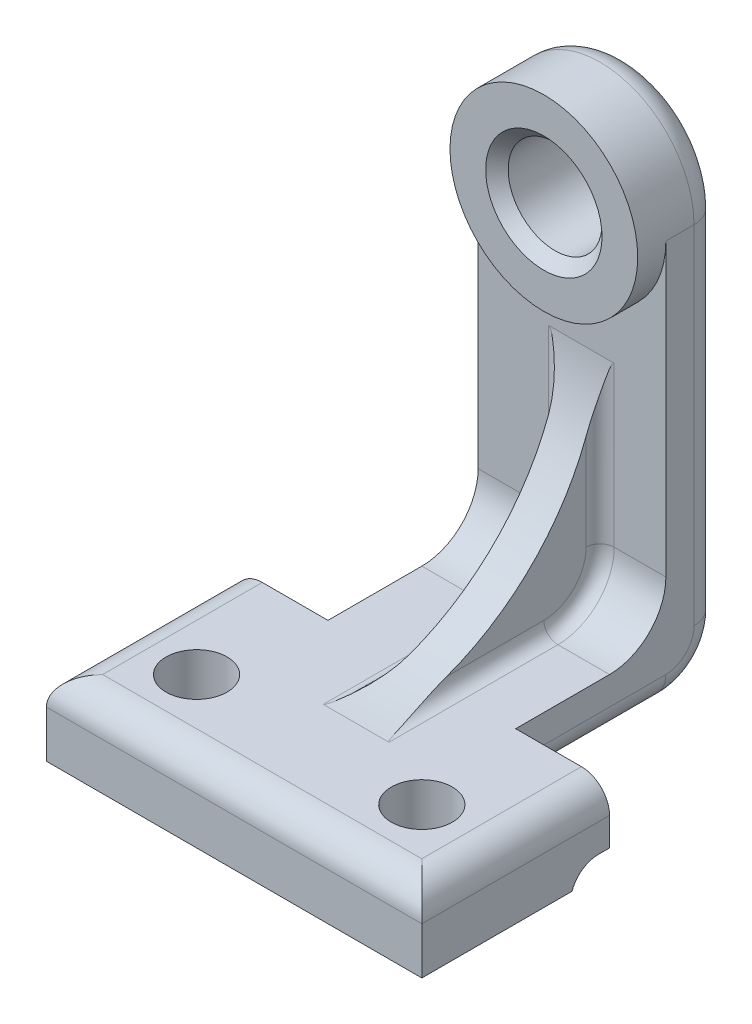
ISO-10303-21;
HEADER;
FILE_DESCRIPTION(('STEP AP214'),'2;1');
FILE_NAME('part.step','',(''),(''),'','','');
FILE_SCHEMA(('AUTOMOTIVE_DESIGN { 1 0 10303 214 1 1 1 1 }'));
ENDSEC;
DATA;
#1=APPLICATION_CONTEXT('core data for automotive mechanical design processes');
#2=APPLICATION_PROTOCOL_DEFINITION('international standard','automotive_design',2000,#1);
#3=PRODUCT_CONTEXT('',#1,'mechanical');
#4=PRODUCT('Part','Part','',(#3));
#5=PRODUCT_RELATED_PRODUCT_CATEGORY('part','',(#4));
#6=PRODUCT_DEFINITION_FORMATION('','',#4);
#7=PRODUCT_DEFINITION_CONTEXT('part definition',#1,'design');
#8=PRODUCT_DEFINITION('design','',#6,#7);
#9=PRODUCT_DEFINITION_SHAPE('','',#8);
#10=(LENGTH_UNIT() NAMED_UNIT(*) SI_UNIT(.MILLI.,.METRE.));
#11=(NAMED_UNIT(*) PLANE_ANGLE_UNIT() SI_UNIT($,.RADIAN.));
#12=(NAMED_UNIT(*) SI_UNIT($,.STERADIAN.) SOLID_ANGLE_UNIT());
#13=UNCERTAINTY_MEASURE_WITH_UNIT(LENGTH_MEASURE(1.E-05),#10,'distance_accuracy_value','');
#14=(GEOMETRIC_REPRESENTATION_CONTEXT(3) GLOBAL_UNCERTAINTY_ASSIGNED_CONTEXT((#13)) GLOBAL_UNIT_ASSIGNED_CONTEXT((#10,
#11,#12)) REPRESENTATION_CONTEXT('',''));
#15=CARTESIAN_POINT('',(0.,0.,0.));
#16=DIRECTION('',(0.,0.,1.));
#17=DIRECTION('',(1.,0.,0.));
#18=AXIS2_PLACEMENT_3D('',#15,#16,#17);
#19=CARTESIAN_POINT('',(0.,0.,6.));
#20=DIRECTION('',(0.,0.,1.));
#21=DIRECTION('',(1.,0.,0.));
#22=AXIS2_PLACEMENT_3D('',#19,#20,#21);
#23=PLANE('',#22);
#24=DIRECTION('',(1.,0.,0.));
#25=VECTOR('',#24,1.);
#26=CARTESIAN_POINT('',(10.,-31.,6.));
#27=LINE('',#26,#25);
#28=CARTESIAN_POINT('',(-10.,-31.,6.));
#29=VERTEX_POINT('',#28);
#30=CARTESIAN_POINT('',(-2.5,-31.,6.));
#31=VERTEX_POINT('',#30);
#32=EDGE_CURVE('E322',#29,#31,#27,.T.);
#33=ORIENTED_EDGE('',*,*,#32,.T.);
#34=DIRECTION('',(0.,1.,0.));
#35=VECTOR('',#34,1.);
#36=CARTESIAN_POINT('',(-2.5,-14.033757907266,6.));
#37=LINE('',#36,#35);
#38=CARTESIAN_POINT('',(-2.5,-14.033757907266,6.));
#39=VERTEX_POINT('',#38);
#40=EDGE_CURVE('E419',#31,#39,#37,.T.);
#41=ORIENTED_EDGE('',*,*,#40,.T.);
#42=DIRECTION('',(-1.,0.,0.));
#43=VECTOR('',#42,1.);
#44=CARTESIAN_POINT('',(3.,-14.033757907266,6.));
#45=LINE('',#44,#43);
#46=CARTESIAN_POINT('',(4.5,-14.033757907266,6.));
#47=VERTEX_POINT('',#46);
#48=EDGE_CURVE('E53',#47,#39,#45,.T.);
#49=ORIENTED_EDGE('',*,*,#48,.F.);
#50=DIRECTION('',(0.,1.,0.));
#51=VECTOR('',#50,1.);
#52=CARTESIAN_POINT('',(4.5,0.,6.));
#53=LINE('',#52,#51);
#54=CARTESIAN_POINT('',(4.5,-31.,6.));
#55=VERTEX_POINT('',#54);
#56=EDGE_CURVE('E417',#47,#55,#53,.F.);
#57=ORIENTED_EDGE('',*,*,#56,.T.);
#58=CARTESIAN_POINT('',(10.,-31.,6.));
#59=VERTEX_POINT('',#58);
#60=EDGE_CURVE('E325',#55,#59,#27,.T.);
#61=ORIENTED_EDGE('',*,*,#60,.T.);
#62=DIRECTION('',(0.,1.,0.));
#63=VECTOR('',#62,1.);
#64=CARTESIAN_POINT('',(10.,0.,6.));
#65=LINE('',#64,#63);
#66=CARTESIAN_POINT('',(10.,0.,6.));
#67=VERTEX_POINT('',#66);
#68=EDGE_CURVE('E310',#59,#67,#65,.T.);
#69=ORIENTED_EDGE('',*,*,#68,.T.);
#70=CARTESIAN_POINT('',(0.,0.,6.));
#71=DIRECTION('',(0.,0.,1.));
#72=DIRECTION('',(1.,0.,0.));
#73=AXIS2_PLACEMENT_3D('',#70,#71,#72);
#74=CIRCLE('',#73,10.);
#75=CARTESIAN_POINT('',(-10.,0.,6.));
#76=VERTEX_POINT('',#75);
#77=EDGE_CURVE('E320',#67,#76,#74,.F.);
#78=ORIENTED_EDGE('',*,*,#77,.T.);
#79=DIRECTION('',(0.,-1.,0.));
#80=VECTOR('',#79,1.);
#81=CARTESIAN_POINT('',(-10.,0.,6.));
#82=LINE('',#81,#80);
#83=EDGE_CURVE('E305',#76,#29,#82,.T.);
#84=ORIENTED_EDGE('',*,*,#83,.T.);
#85=EDGE_LOOP('',(#33,#41,#49,#57,#61,#69,#78,#84));
#86=FACE_BOUND('',#85,.T.);
#87=ADVANCED_FACE('F34',(#86),#23,.T.);
#88=CARTESIAN_POINT('',(-10.,-37.,0.));
#89=DIRECTION('',(0.,1.,0.));
#90=DIRECTION('',(0.,0.,1.));
#91=AXIS2_PLACEMENT_3D('',#88,#89,#90);
#92=PLANE('',#91);
#93=CARTESIAN_POINT('',(-12.,-37.,34.));
#94=DIRECTION('',(0.,1.,0.));
#95=DIRECTION('',(0.,0.,1.));
#96=AXIS2_PLACEMENT_3D('',#93,#94,#95);
#97=CIRCLE('',#96,3.25);
#98=CARTESIAN_POINT('',(-12.,-37.,37.25));
#99=VERTEX_POINT('',#98);
#100=EDGE_CURVE('E277',#99,#99,#97,.T.);
#101=ORIENTED_EDGE('',*,*,#100,.F.);
#102=EDGE_LOOP('',(#101));
#103=FACE_BOUND('',#102,.T.);
#104=CARTESIAN_POINT('',(12.,-37.,34.));
#105=DIRECTION('',(0.,1.,0.));
#106=DIRECTION('',(0.,0.,1.));
#107=AXIS2_PLACEMENT_3D('',#104,#105,#106);
#108=CIRCLE('',#107,3.25);
#109=CARTESIAN_POINT('',(12.,-37.,37.25));
#110=VERTEX_POINT('',#109);
#111=EDGE_CURVE('E271',#110,#110,#108,.T.);
#112=ORIENTED_EDGE('',*,*,#111,.F.);
#113=EDGE_LOOP('',(#112));
#114=FACE_BOUND('',#113,.T.);
#115=DIRECTION('',(1.,0.,0.));
#116=VECTOR('',#115,1.);
#117=CARTESIAN_POINT('',(-10.,-37.,12.));
#118=LINE('',#117,#116);
#119=CARTESIAN_POINT('',(10.,-37.,12.));
#120=VERTEX_POINT('',#119);
#121=CARTESIAN_POINT('',(4.5,-37.,12.));
#122=VERTEX_POINT('',#121);
#123=EDGE_CURVE('E326',#120,#122,#118,.F.);
#124=ORIENTED_EDGE('',*,*,#123,.T.);
#125=DIRECTION('',(0.,0.,-1.));
#126=VECTOR('',#125,1.);
#127=CARTESIAN_POINT('',(4.5,-37.,0.));
#128=LINE('',#127,#126);
#129=CARTESIAN_POINT('',(4.5,-37.,30.));
#130=VERTEX_POINT('',#129);
#131=EDGE_CURVE('E408',#122,#130,#128,.F.);
#132=ORIENTED_EDGE('',*,*,#131,.T.);
#133=DIRECTION('',(-1.,0.,0.));
#134=VECTOR('',#133,1.);
#135=CARTESIAN_POINT('',(3.,-37.,30.));
#136=LINE('',#135,#134);
#137=CARTESIAN_POINT('',(-2.5,-37.,30.));
#138=VERTEX_POINT('',#137);
#139=EDGE_CURVE('E545',#130,#138,#136,.T.);
#140=ORIENTED_EDGE('',*,*,#139,.T.);
#141=DIRECTION('',(0.,0.,-1.));
#142=VECTOR('',#141,1.);
#143=CARTESIAN_POINT('',(-2.5,-37.,12.));
#144=LINE('',#143,#142);
#145=CARTESIAN_POINT('',(-2.5,-37.,12.));
#146=VERTEX_POINT('',#145);
#147=EDGE_CURVE('E406',#138,#146,#144,.T.);
#148=ORIENTED_EDGE('',*,*,#147,.T.);
#149=CARTESIAN_POINT('',(-10.,-37.,12.));
#150=VERTEX_POINT('',#149);
#151=EDGE_CURVE('E248',#146,#150,#118,.F.);
#152=ORIENTED_EDGE('',*,*,#151,.T.);
#153=DIRECTION('',(0.,0.,-1.));
#154=VECTOR('',#153,1.);
#155=CARTESIAN_POINT('',(-10.,-37.,0.));
#156=LINE('',#155,#154);
#157=CARTESIAN_POINT('',(-10.,-37.,22.));
#158=VERTEX_POINT('',#157);
#159=EDGE_CURVE('E232',#158,#150,#156,.T.);
#160=ORIENTED_EDGE('',*,*,#159,.F.);
#161=DIRECTION('',(1.,0.,0.));
#162=VECTOR('',#161,1.);
#163=CARTESIAN_POINT('',(-20.,-37.,22.));
#164=LINE('',#163,#162);
#165=CARTESIAN_POINT('',(-17.,-37.,22.));
#166=VERTEX_POINT('',#165);
#167=EDGE_CURVE('E220',#166,#158,#164,.T.);
#168=ORIENTED_EDGE('',*,*,#167,.F.);
#169=DIRECTION('',(0.,0.,1.));
#170=VECTOR('',#169,1.);
#171=CARTESIAN_POINT('',(-17.,-37.,0.));
#172=LINE('',#171,#170);
#173=CARTESIAN_POINT('',(-17.,-37.,39.));
#174=VERTEX_POINT('',#173);
#175=EDGE_CURVE('E369',#166,#174,#172,.T.);
#176=ORIENTED_EDGE('',*,*,#175,.T.);
#177=DIRECTION('',(1.,0.,0.));
#178=VECTOR('',#177,1.);
#179=CARTESIAN_POINT('',(-10.,-37.,39.));
#180=LINE('',#179,#178);
#181=CARTESIAN_POINT('',(17.,-37.,39.));
#182=VERTEX_POINT('',#181);
#183=EDGE_CURVE('E371',#174,#182,#180,.T.);
#184=ORIENTED_EDGE('',*,*,#183,.T.);
#185=DIRECTION('',(0.,0.,1.));
#186=VECTOR('',#185,1.);
#187=CARTESIAN_POINT('',(17.,-37.,0.));
#188=LINE('',#187,#186);
#189=CARTESIAN_POINT('',(17.,-37.,22.));
#190=VERTEX_POINT('',#189);
#191=EDGE_CURVE('E374',#182,#190,#188,.F.);
#192=ORIENTED_EDGE('',*,*,#191,.T.);
#193=DIRECTION('',(1.,0.,0.));
#194=VECTOR('',#193,1.);
#195=CARTESIAN_POINT('',(10.,-37.,22.));
#196=LINE('',#195,#194);
#197=CARTESIAN_POINT('',(10.,-37.,22.));
#198=VERTEX_POINT('',#197);
#199=EDGE_CURVE('E257',#198,#190,#196,.T.);
#200=ORIENTED_EDGE('',*,*,#199,.F.);
#201=DIRECTION('',(0.,0.,1.));
#202=VECTOR('',#201,1.);
#203=CARTESIAN_POINT('',(10.,-37.,0.));
#204=LINE('',#203,#202);
#205=EDGE_CURVE('E254',#120,#198,#204,.T.);
#206=ORIENTED_EDGE('',*,*,#205,.F.);
#207=EDGE_LOOP('',(#124,#132,#140,#148,#152,#160,#168,#176,#184,#192,#200,#206));
#208=FACE_BOUND('',#207,.T.);
#209=ADVANCED_FACE('F245',(#103,#114,#208),#92,.T.);
#210=CARTESIAN_POINT('',(0.,-31.,12.));
#211=DIRECTION('',(-1.,0.,0.));
#212=DIRECTION('',(0.,0.,1.));
#213=AXIS2_PLACEMENT_3D('',#210,#211,#212);
#214=CYLINDRICAL_SURFACE('',#213,6.);
#215=ORIENTED_EDGE('',*,*,#60,.F.);
#216=CARTESIAN_POINT('',(4.5,-31.,12.));
#217=DIRECTION('',(-1.,0.,0.));
#218=DIRECTION('',(0.,0.,1.));
#219=AXIS2_PLACEMENT_3D('',#216,#217,#218);
#220=CIRCLE('',#219,6.);
#221=EDGE_CURVE('E421',#55,#122,#220,.T.);
#222=ORIENTED_EDGE('',*,*,#221,.T.);
#223=ORIENTED_EDGE('',*,*,#123,.F.);
#224=CARTESIAN_POINT('',(10.,-31.,12.));
#225=DIRECTION('',(-1.,0.,0.));
#226=DIRECTION('',(0.,0.,1.));
#227=AXIS2_PLACEMENT_3D('',#224,#225,#226);
#228=CIRCLE('',#227,6.);
#229=EDGE_CURVE('E334',#59,#120,#228,.T.);
#230=ORIENTED_EDGE('',*,*,#229,.F.);
#231=EDGE_LOOP('',(#215,#222,#223,#230));
#232=FACE_BOUND('',#231,.T.);
#233=ADVANCED_FACE('F473',(#232),#214,.F.);
#234=CARTESIAN_POINT('',(0.,0.,6.));
#235=DIRECTION('',(0.,0.,-1.));
#236=DIRECTION('',(-1.,0.,0.));
#237=AXIS2_PLACEMENT_3D('',#234,#235,#236);
#238=CYLINDRICAL_SURFACE('',#237,10.);
#239=DIRECTION('',(0.,0.,-1.));
#240=VECTOR('',#239,1.);
#241=CARTESIAN_POINT('',(10.,0.,6.));
#242=LINE('',#241,#240);
#243=CARTESIAN_POINT('',(10.,0.,3.));
#244=VERTEX_POINT('',#243);
#245=EDGE_CURVE('E306',#67,#244,#242,.T.);
#246=ORIENTED_EDGE('',*,*,#245,.T.);
#247=CARTESIAN_POINT('',(0.,0.,3.));
#248=DIRECTION('',(0.,0.,1.));
#249=DIRECTION('',(1.,0.,0.));
#250=AXIS2_PLACEMENT_3D('',#247,#248,#249);
#251=CIRCLE('',#250,10.);
#252=CARTESIAN_POINT('',(-10.,0.,3.));
#253=VERTEX_POINT('',#252);
#254=EDGE_CURVE('E367',#244,#253,#251,.T.);
#255=ORIENTED_EDGE('',*,*,#254,.T.);
#256=DIRECTION('',(0.,0.,-1.));
#257=VECTOR('',#256,1.);
#258=CARTESIAN_POINT('',(-10.,0.,6.));
#259=LINE('',#258,#257);
#260=EDGE_CURVE('E309',#76,#253,#259,.T.);
#261=ORIENTED_EDGE('',*,*,#260,.F.);
#262=ORIENTED_EDGE('',*,*,#77,.F.);
#263=EDGE_LOOP('',(#246,#255,#261,#262));
#264=FACE_BOUND('',#263,.T.);
#265=CARTESIAN_POINT('',(0.,0.,9.));
#266=DIRECTION('',(0.,0.,1.));
#267=DIRECTION('',(1.,0.,0.));
#268=AXIS2_PLACEMENT_3D('',#265,#266,#267);
#269=CIRCLE('',#268,10.);
#270=CARTESIAN_POINT('',(10.,0.,9.));
#271=VERTEX_POINT('',#270);
#272=EDGE_CURVE('E299',#271,#271,#269,.T.);
#273=ORIENTED_EDGE('',*,*,#272,.F.);
#274=EDGE_LOOP('',(#273));
#275=FACE_BOUND('',#274,.T.);
#276=ADVANCED_FACE('F36',(#264,#275),#238,.T.);
#277=CARTESIAN_POINT('',(-10.,0.,6.));
#278=DIRECTION('',(1.,0.,0.));
#279=DIRECTION('',(0.,0.,-1.));
#280=AXIS2_PLACEMENT_3D('',#277,#278,#279);
#281=PLANE('',#280);
#282=CARTESIAN_POINT('',(-10.,-37.,6.));
#283=DIRECTION('',(1.,0.,0.));
#284=DIRECTION('',(0.,0.,-1.));
#285=AXIS2_PLACEMENT_3D('',#282,#283,#284);
#286=CIRCLE('',#285,3.);
#287=CARTESIAN_POINT('',(-10.,-37.,3.));
#288=VERTEX_POINT('',#287);
#289=CARTESIAN_POINT('',(-10.,-40.,6.));
#290=VERTEX_POINT('',#289);
#291=EDGE_CURVE('E354',#288,#290,#286,.F.);
#292=ORIENTED_EDGE('',*,*,#291,.T.);
#293=DIRECTION('',(0.,0.,-1.));
#294=VECTOR('',#293,1.);
#295=CARTESIAN_POINT('',(-10.,-40.,6.));
#296=LINE('',#295,#294);
#297=CARTESIAN_POINT('',(-10.,-40.,22.));
#298=VERTEX_POINT('',#297);
#299=EDGE_CURVE('E240',#290,#298,#296,.F.);
#300=ORIENTED_EDGE('',*,*,#299,.T.);
#301=DIRECTION('',(0.,1.,0.));
#302=VECTOR('',#301,1.);
#303=CARTESIAN_POINT('',(-10.,-45.,22.));
#304=LINE('',#303,#302);
#305=EDGE_CURVE('E225',#298,#158,#304,.T.);
#306=ORIENTED_EDGE('',*,*,#305,.T.);
#307=ORIENTED_EDGE('',*,*,#159,.T.);
#308=CARTESIAN_POINT('',(-10.,-31.,12.));
#309=DIRECTION('',(1.,0.,0.));
#310=DIRECTION('',(0.,0.,-1.));
#311=AXIS2_PLACEMENT_3D('',#308,#309,#310);
#312=CIRCLE('',#311,6.);
#313=EDGE_CURVE('E337',#150,#29,#312,.T.);
#314=ORIENTED_EDGE('',*,*,#313,.T.);
#315=ORIENTED_EDGE('',*,*,#83,.F.);
#316=ORIENTED_EDGE('',*,*,#260,.T.);
#317=DIRECTION('',(0.,-1.,0.));
#318=VECTOR('',#317,1.);
#319=CARTESIAN_POINT('',(-10.,0.,3.));
#320=LINE('',#319,#318);
#321=EDGE_CURVE('E352',#253,#288,#320,.T.);
#322=ORIENTED_EDGE('',*,*,#321,.T.);
#323=EDGE_LOOP('',(#292,#300,#306,#307,#314,#315,#316,#322));
#324=FACE_BOUND('',#323,.T.);
#325=ADVANCED_FACE('F237',(#324),#281,.F.);
#326=CARTESIAN_POINT('',(10.,0.,6.));
#327=DIRECTION('',(-1.,0.,0.));
#328=DIRECTION('',(0.,0.,1.));
#329=AXIS2_PLACEMENT_3D('',#326,#327,#328);
#330=PLANE('',#329);
#331=DIRECTION('',(0.,1.,0.));
#332=VECTOR('',#331,1.);
#333=CARTESIAN_POINT('',(10.,-45.,22.));
#334=LINE('',#333,#332);
#335=CARTESIAN_POINT('',(10.,-40.,22.));
#336=VERTEX_POINT('',#335);
#337=EDGE_CURVE('E260',#336,#198,#334,.T.);
#338=ORIENTED_EDGE('',*,*,#337,.F.);
#339=DIRECTION('',(0.,0.,1.));
#340=VECTOR('',#339,1.);
#341=CARTESIAN_POINT('',(10.,-40.,6.));
#342=LINE('',#341,#340);
#343=CARTESIAN_POINT('',(10.,-40.,6.));
#344=VERTEX_POINT('',#343);
#345=EDGE_CURVE('E350',#336,#344,#342,.F.);
#346=ORIENTED_EDGE('',*,*,#345,.T.);
#347=CARTESIAN_POINT('',(10.,-37.,6.));
#348=DIRECTION('',(-1.,0.,0.));
#349=DIRECTION('',(0.,0.,1.));
#350=AXIS2_PLACEMENT_3D('',#347,#348,#349);
#351=CIRCLE('',#350,3.);
#352=CARTESIAN_POINT('',(10.,-37.,3.));
#353=VERTEX_POINT('',#352);
#354=EDGE_CURVE('E348',#344,#353,#351,.F.);
#355=ORIENTED_EDGE('',*,*,#354,.T.);
#356=DIRECTION('',(0.,1.,0.));
#357=VECTOR('',#356,1.);
#358=CARTESIAN_POINT('',(10.,0.,3.));
#359=LINE('',#358,#357);
#360=EDGE_CURVE('E346',#353,#244,#359,.T.);
#361=ORIENTED_EDGE('',*,*,#360,.T.);
#362=ORIENTED_EDGE('',*,*,#245,.F.);
#363=ORIENTED_EDGE('',*,*,#68,.F.);
#364=ORIENTED_EDGE('',*,*,#229,.T.);
#365=ORIENTED_EDGE('',*,*,#205,.T.);
#366=EDGE_LOOP('',(#338,#346,#355,#361,#362,#363,#364,#365));
#367=FACE_BOUND('',#366,.T.);
#368=ADVANCED_FACE('F480',(#367),#330,.F.);
#369=CARTESIAN_POINT('',(0.,0.,0.));
#370=DIRECTION('',(0.,0.,1.));
#371=DIRECTION('',(1.,0.,0.));
#372=AXIS2_PLACEMENT_3D('',#369,#370,#371);
#373=PLANE('',#372);
#374=CARTESIAN_POINT('',(0.,0.,0.));
#375=DIRECTION('',(0.,0.,1.));
#376=DIRECTION('',(1.,0.,0.));
#377=AXIS2_PLACEMENT_3D('',#374,#375,#376);
#378=CIRCLE('',#377,5.);
#379=CARTESIAN_POINT('',(5.,0.,0.));
#380=VERTEX_POINT('',#379);
#381=EDGE_CURVE('E280',#380,#380,#378,.T.);
#382=ORIENTED_EDGE('',*,*,#381,.T.);
#383=EDGE_LOOP('',(#382));
#384=FACE_BOUND('',#383,.T.);
#385=CARTESIAN_POINT('',(0.,0.,0.));
#386=DIRECTION('',(0.,0.,1.));
#387=DIRECTION('',(1.,0.,0.));
#388=AXIS2_PLACEMENT_3D('',#385,#386,#387);
#389=CIRCLE('',#388,7.);
#390=CARTESIAN_POINT('',(-7.,0.,0.));
#391=VERTEX_POINT('',#390);
#392=CARTESIAN_POINT('',(7.,0.,0.));
#393=VERTEX_POINT('',#392);
#394=EDGE_CURVE('E361',#391,#393,#389,.F.);
#395=ORIENTED_EDGE('',*,*,#394,.T.);
#396=DIRECTION('',(0.,1.,0.));
#397=VECTOR('',#396,1.);
#398=CARTESIAN_POINT('',(7.,0.,0.));
#399=LINE('',#398,#397);
#400=CARTESIAN_POINT('',(7.,-37.,0.));
#401=VERTEX_POINT('',#400);
#402=EDGE_CURVE('E365',#393,#401,#399,.F.);
#403=ORIENTED_EDGE('',*,*,#402,.T.);
#404=DIRECTION('',(1.,0.,0.));
#405=VECTOR('',#404,1.);
#406=CARTESIAN_POINT('',(0.,-37.,0.));
#407=LINE('',#406,#405);
#408=CARTESIAN_POINT('',(-7.,-37.,0.));
#409=VERTEX_POINT('',#408);
#410=EDGE_CURVE('E331',#401,#409,#407,.F.);
#411=ORIENTED_EDGE('',*,*,#410,.T.);
#412=DIRECTION('',(0.,-1.,0.));
#413=VECTOR('',#412,1.);
#414=CARTESIAN_POINT('',(-7.,0.,0.));
#415=LINE('',#414,#413);
#416=EDGE_CURVE('E363',#409,#391,#415,.F.);
#417=ORIENTED_EDGE('',*,*,#416,.T.);
#418=EDGE_LOOP('',(#395,#403,#411,#417));
#419=FACE_BOUND('',#418,.T.);
#420=ADVANCED_FACE('F478',(#384,#419),#373,.F.);
#421=CARTESIAN_POINT('',(-10.,-37.,42.));
#422=DIRECTION('',(0.,0.,1.));
#423=DIRECTION('',(0.,-1.,0.));
#424=AXIS2_PLACEMENT_3D('',#421,#422,#423);
#425=PLANE('',#424);
#426=DIRECTION('',(0.,1.,0.));
#427=VECTOR('',#426,1.);
#428=CARTESIAN_POINT('',(20.,-37.,42.));
#429=LINE('',#428,#427);
#430=CARTESIAN_POINT('',(20.,-45.,42.));
#431=VERTEX_POINT('',#430);
#432=CARTESIAN_POINT('',(20.,-40.,42.));
#433=VERTEX_POINT('',#432);
#434=EDGE_CURVE('E294',#431,#433,#429,.T.);
#435=ORIENTED_EDGE('',*,*,#434,.T.);
#436=DIRECTION('',(1.,0.,0.));
#437=VECTOR('',#436,1.);
#438=CARTESIAN_POINT('',(-10.,-40.,42.));
#439=LINE('',#438,#437);
#440=CARTESIAN_POINT('',(-20.,-40.,42.));
#441=VERTEX_POINT('',#440);
#442=EDGE_CURVE('E376',#433,#441,#439,.F.);
#443=ORIENTED_EDGE('',*,*,#442,.T.);
#444=DIRECTION('',(0.,-1.,0.));
#445=VECTOR('',#444,1.);
#446=CARTESIAN_POINT('',(-20.,-37.,42.));
#447=LINE('',#446,#445);
#448=CARTESIAN_POINT('',(-20.,-45.,42.));
#449=VERTEX_POINT('',#448);
#450=EDGE_CURVE('E289',#441,#449,#447,.T.);
#451=ORIENTED_EDGE('',*,*,#450,.T.);
#452=DIRECTION('',(1.,0.,0.));
#453=VECTOR('',#452,1.);
#454=CARTESIAN_POINT('',(-10.,-45.,42.));
#455=LINE('',#454,#453);
#456=EDGE_CURVE('E302',#449,#431,#455,.T.);
#457=ORIENTED_EDGE('',*,*,#456,.T.);
#458=EDGE_LOOP('',(#435,#443,#451,#457));
#459=FACE_BOUND('',#458,.T.);
#460=ADVANCED_FACE('F519',(#459),#425,.T.);
#461=CARTESIAN_POINT('',(-10.,-45.,0.));
#462=DIRECTION('',(0.,-1.,0.));
#463=DIRECTION('',(0.,0.,-1.));
#464=AXIS2_PLACEMENT_3D('',#461,#462,#463);
#465=PLANE('',#464);
#466=CARTESIAN_POINT('',(12.,-45.,34.));
#467=DIRECTION('',(0.,1.,0.));
#468=DIRECTION('',(0.,0.,1.));
#469=AXIS2_PLACEMENT_3D('',#466,#467,#468);
#470=CIRCLE('',#469,3.25);
#471=CARTESIAN_POINT('',(12.,-45.,37.25));
#472=VERTEX_POINT('',#471);
#473=EDGE_CURVE('E268',#472,#472,#470,.T.);
#474=ORIENTED_EDGE('',*,*,#473,.T.);
#475=EDGE_LOOP('',(#474));
#476=FACE_BOUND('',#475,.T.);
#477=CARTESIAN_POINT('',(-12.,-45.,34.));
#478=DIRECTION('',(0.,1.,0.));
#479=DIRECTION('',(0.,0.,1.));
#480=AXIS2_PLACEMENT_3D('',#477,#478,#479);
#481=CIRCLE('',#480,3.25);
#482=CARTESIAN_POINT('',(-12.,-45.,37.25));
#483=VERTEX_POINT('',#482);
#484=EDGE_CURVE('E274',#483,#483,#481,.T.);
#485=ORIENTED_EDGE('',*,*,#484,.T.);
#486=EDGE_LOOP('',(#485));
#487=FACE_BOUND('',#486,.T.);
#488=DIRECTION('',(-1.,0.,0.));
#489=VECTOR('',#488,1.);
#490=CARTESIAN_POINT('',(-10.,-45.,26.));
#491=LINE('',#490,#489);
#492=CARTESIAN_POINT('',(20.,-45.,26.));
#493=VERTEX_POINT('',#492);
#494=CARTESIAN_POINT('',(-20.,-45.,26.));
#495=VERTEX_POINT('',#494);
#496=EDGE_CURVE('E313',#493,#495,#491,.T.);
#497=ORIENTED_EDGE('',*,*,#496,.F.);
#498=DIRECTION('',(0.,0.,1.));
#499=VECTOR('',#498,1.);
#500=CARTESIAN_POINT('',(20.,-45.,0.));
#501=LINE('',#500,#499);
#502=EDGE_CURVE('E297',#493,#431,#501,.T.);
#503=ORIENTED_EDGE('',*,*,#502,.T.);
#504=ORIENTED_EDGE('',*,*,#456,.F.);
#505=DIRECTION('',(0.,0.,1.));
#506=VECTOR('',#505,1.);
#507=CARTESIAN_POINT('',(-20.,-45.,0.));
#508=LINE('',#507,#506);
#509=EDGE_CURVE('E291',#495,#449,#508,.T.);
#510=ORIENTED_EDGE('',*,*,#509,.F.);
#511=EDGE_LOOP('',(#497,#503,#504,#510));
#512=FACE_BOUND('',#511,.T.);
#513=ADVANCED_FACE('F513',(#476,#487,#512),#465,.T.);
#514=CARTESIAN_POINT('',(-10.00005,-43.,26.));
#515=DIRECTION('',(0.,1.,0.));
#516=DIRECTION('',(0.,0.,1.));
#517=AXIS2_PLACEMENT_3D('',#514,#515,#516);
#518=PLANE('',#517);
#519=DIRECTION('',(1.,0.,0.));
#520=VECTOR('',#519,1.);
#521=CARTESIAN_POINT('',(-10.00005,-43.,6.));
#522=LINE('',#521,#520);
#523=CARTESIAN_POINT('',(-7.,-43.,6.));
#524=VERTEX_POINT('',#523);
#525=CARTESIAN_POINT('',(7.,-43.,6.));
#526=VERTEX_POINT('',#525);
#527=EDGE_CURVE('E328',#524,#526,#522,.T.);
#528=ORIENTED_EDGE('',*,*,#527,.T.);
#529=DIRECTION('',(0.,0.,1.));
#530=VECTOR('',#529,1.);
#531=CARTESIAN_POINT('',(7.,-43.,26.));
#532=LINE('',#531,#530);
#533=CARTESIAN_POINT('',(7.,-43.,22.));
#534=VERTEX_POINT('',#533);
#535=EDGE_CURVE('E343',#526,#534,#532,.T.);
#536=ORIENTED_EDGE('',*,*,#535,.T.);
#537=DIRECTION('',(1.,0.,0.));
#538=VECTOR('',#537,1.);
#539=CARTESIAN_POINT('',(-10.00005,-43.,22.));
#540=LINE('',#539,#538);
#541=CARTESIAN_POINT('',(20.,-43.,22.));
#542=VERTEX_POINT('',#541);
#543=EDGE_CURVE('E264',#534,#542,#540,.T.);
#544=ORIENTED_EDGE('',*,*,#543,.T.);
#545=DIRECTION('',(0.,0.,1.));
#546=VECTOR('',#545,1.);
#547=CARTESIAN_POINT('',(20.,-43.,26.));
#548=LINE('',#547,#546);
#549=CARTESIAN_POINT('',(20.,-43.,23.1715728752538));
#550=VERTEX_POINT('',#549);
#551=EDGE_CURVE('E283',#542,#550,#548,.T.);
#552=ORIENTED_EDGE('',*,*,#551,.T.);
#553=DIRECTION('',(1.,0.,0.));
#554=VECTOR('',#553,1.);
#555=CARTESIAN_POINT('',(-10.00005,-43.,23.1715728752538));
#556=LINE('',#555,#554);
#557=CARTESIAN_POINT('',(-20.,-43.,23.1715728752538));
#558=VERTEX_POINT('',#557);
#559=EDGE_CURVE('E339',#550,#558,#556,.F.);
#560=ORIENTED_EDGE('',*,*,#559,.T.);
#561=DIRECTION('',(0.,0.,1.));
#562=VECTOR('',#561,1.);
#563=CARTESIAN_POINT('',(-20.,-43.,26.));
#564=LINE('',#563,#562);
#565=CARTESIAN_POINT('',(-20.,-43.,22.));
#566=VERTEX_POINT('',#565);
#567=EDGE_CURVE('E286',#566,#558,#564,.T.);
#568=ORIENTED_EDGE('',*,*,#567,.F.);
#569=DIRECTION('',(1.,0.,0.));
#570=VECTOR('',#569,1.);
#571=CARTESIAN_POINT('',(-10.00005,-43.,22.));
#572=LINE('',#571,#570);
#573=CARTESIAN_POINT('',(-7.,-43.,22.));
#574=VERTEX_POINT('',#573);
#575=EDGE_CURVE('E241',#566,#574,#572,.T.);
#576=ORIENTED_EDGE('',*,*,#575,.T.);
#577=DIRECTION('',(0.,0.,-1.));
#578=VECTOR('',#577,1.);
#579=CARTESIAN_POINT('',(-7.,-43.,26.));
#580=LINE('',#579,#578);
#581=EDGE_CURVE('E341',#574,#524,#580,.T.);
#582=ORIENTED_EDGE('',*,*,#581,.T.);
#583=EDGE_LOOP('',(#528,#536,#544,#552,#560,#568,#576,#582));
#584=FACE_BOUND('',#583,.T.);
#585=ADVANCED_FACE('F503',(#584),#518,.F.);
#586=CARTESIAN_POINT('',(0.,0.,9.));
#587=DIRECTION('',(0.,0.,1.));
#588=DIRECTION('',(1.,0.,0.));
#589=AXIS2_PLACEMENT_3D('',#586,#587,#588);
#590=PLANE('',#589);
#591=CARTESIAN_POINT('',(0.,0.,9.));
#592=DIRECTION('',(0.,0.,1.));
#593=DIRECTION('',(1.,0.,0.));
#594=AXIS2_PLACEMENT_3D('',#591,#592,#593);
#595=CIRCLE('',#594,6.2);
#596=CARTESIAN_POINT('',(6.2,0.,9.));
#597=VERTEX_POINT('',#596);
#598=EDGE_CURVE('E396',#597,#597,#595,.F.);
#599=ORIENTED_EDGE('',*,*,#598,.T.);
#600=EDGE_LOOP('',(#599));
#601=FACE_BOUND('',#600,.T.);
#602=ORIENTED_EDGE('',*,*,#272,.T.);
#603=EDGE_LOOP('',(#602));
#604=FACE_BOUND('',#603,.T.);
#605=ADVANCED_FACE('F500',(#601,#604),#590,.T.);
#606=CARTESIAN_POINT('',(20.,-37.,0.));
#607=DIRECTION('',(1.,0.,0.));
#608=DIRECTION('',(0.,1.,0.));
#609=AXIS2_PLACEMENT_3D('',#606,#607,#608);
#610=PLANE('',#609);
#611=DIRECTION('',(0.,1.,0.));
#612=VECTOR('',#611,1.);
#613=CARTESIAN_POINT('',(20.,-45.,22.));
#614=LINE('',#613,#612);
#615=CARTESIAN_POINT('',(20.,-40.,22.));
#616=VERTEX_POINT('',#615);
#617=EDGE_CURVE('E261',#542,#616,#614,.T.);
#618=ORIENTED_EDGE('',*,*,#617,.T.);
#619=DIRECTION('',(0.,0.,1.));
#620=VECTOR('',#619,1.);
#621=CARTESIAN_POINT('',(20.,-40.,0.));
#622=LINE('',#621,#620);
#623=EDGE_CURVE('E378',#616,#433,#622,.T.);
#624=ORIENTED_EDGE('',*,*,#623,.T.);
#625=ORIENTED_EDGE('',*,*,#434,.F.);
#626=ORIENTED_EDGE('',*,*,#502,.F.);
#627=CARTESIAN_POINT('',(20.,-46.,23.1715728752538));
#628=DIRECTION('',(1.,0.,0.));
#629=DIRECTION('',(0.,1.,0.));
#630=AXIS2_PLACEMENT_3D('',#627,#628,#629);
#631=CIRCLE('',#630,3.);
#632=EDGE_CURVE('E389',#493,#550,#631,.F.);
#633=ORIENTED_EDGE('',*,*,#632,.T.);
#634=ORIENTED_EDGE('',*,*,#551,.F.);
#635=EDGE_LOOP('',(#618,#624,#625,#626,#633,#634));
#636=FACE_BOUND('',#635,.T.);
#637=ADVANCED_FACE('F502',(#636),#610,.T.);
#638=CARTESIAN_POINT('',(-20.,-37.,0.));
#639=DIRECTION('',(-1.,0.,0.));
#640=DIRECTION('',(0.,0.,1.));
#641=AXIS2_PLACEMENT_3D('',#638,#639,#640);
#642=PLANE('',#641);
#643=ORIENTED_EDGE('',*,*,#450,.F.);
#644=DIRECTION('',(0.,0.,1.));
#645=VECTOR('',#644,1.);
#646=CARTESIAN_POINT('',(-20.,-40.,0.));
#647=LINE('',#646,#645);
#648=CARTESIAN_POINT('',(-20.,-40.,22.));
#649=VERTEX_POINT('',#648);
#650=EDGE_CURVE('E382',#441,#649,#647,.F.);
#651=ORIENTED_EDGE('',*,*,#650,.T.);
#652=DIRECTION('',(0.,1.,0.));
#653=VECTOR('',#652,1.);
#654=CARTESIAN_POINT('',(-20.,-45.,22.));
#655=LINE('',#654,#653);
#656=EDGE_CURVE('E242',#566,#649,#655,.T.);
#657=ORIENTED_EDGE('',*,*,#656,.F.);
#658=ORIENTED_EDGE('',*,*,#567,.T.);
#659=CARTESIAN_POINT('',(-20.,-46.,23.1715728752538));
#660=DIRECTION('',(-1.,0.,0.));
#661=DIRECTION('',(0.,0.,1.));
#662=AXIS2_PLACEMENT_3D('',#659,#660,#661);
#663=CIRCLE('',#662,3.);
#664=EDGE_CURVE('E391',#558,#495,#663,.F.);
#665=ORIENTED_EDGE('',*,*,#664,.T.);
#666=ORIENTED_EDGE('',*,*,#509,.T.);
#667=EDGE_LOOP('',(#643,#651,#657,#658,#665,#666));
#668=FACE_BOUND('',#667,.T.);
#669=ADVANCED_FACE('F510',(#668),#642,.T.);
#670=ORIENTED_EDGE('',*,*,#151,.F.);
#671=CARTESIAN_POINT('',(-2.5,-31.,12.));
#672=DIRECTION('',(-1.,0.,0.));
#673=DIRECTION('',(0.,0.,1.));
#674=AXIS2_PLACEMENT_3D('',#671,#672,#673);
#675=CIRCLE('',#674,6.);
#676=EDGE_CURVE('E423',#146,#31,#675,.F.);
#677=ORIENTED_EDGE('',*,*,#676,.T.);
#678=ORIENTED_EDGE('',*,*,#32,.F.);
#679=ORIENTED_EDGE('',*,*,#313,.F.);
#680=EDGE_LOOP('',(#670,#677,#678,#679));
#681=FACE_BOUND('',#680,.T.);
#682=ADVANCED_FACE('F493',(#681),#214,.F.);
#683=CARTESIAN_POINT('',(-10.00005,-37.,6.));
#684=DIRECTION('',(1.,0.,0.));
#685=DIRECTION('',(0.,0.,-1.));
#686=AXIS2_PLACEMENT_3D('',#683,#684,#685);
#687=CYLINDRICAL_SURFACE('',#686,6.);
#688=ORIENTED_EDGE('',*,*,#410,.F.);
#689=CARTESIAN_POINT('',(7.,-37.,6.));
#690=DIRECTION('',(-1.,0.,0.));
#691=DIRECTION('',(0.,0.,1.));
#692=AXIS2_PLACEMENT_3D('',#689,#690,#691);
#693=CIRCLE('',#692,6.);
#694=EDGE_CURVE('E359',#401,#526,#693,.T.);
#695=ORIENTED_EDGE('',*,*,#694,.T.);
#696=ORIENTED_EDGE('',*,*,#527,.F.);
#697=CARTESIAN_POINT('',(-7.,-37.,6.));
#698=DIRECTION('',(1.,0.,0.));
#699=DIRECTION('',(0.,0.,-1.));
#700=AXIS2_PLACEMENT_3D('',#697,#698,#699);
#701=CIRCLE('',#700,6.);
#702=EDGE_CURVE('E357',#524,#409,#701,.T.);
#703=ORIENTED_EDGE('',*,*,#702,.T.);
#704=EDGE_LOOP('',(#688,#695,#696,#703));
#705=FACE_BOUND('',#704,.T.);
#706=ADVANCED_FACE('F652',(#705),#687,.T.);
#707=CARTESIAN_POINT('',(0.,0.,-0.999999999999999));
#708=DIRECTION('',(0.,0.,1.));
#709=DIRECTION('',(1.,0.,0.));
#710=AXIS2_PLACEMENT_3D('',#707,#708,#709);
#711=CYLINDRICAL_SURFACE('',#710,5.);
#712=CARTESIAN_POINT('',(0.,0.,7.8));
#713=DIRECTION('',(0.,0.,1.));
#714=DIRECTION('',(1.,0.,0.));
#715=AXIS2_PLACEMENT_3D('',#712,#713,#714);
#716=CIRCLE('',#715,5.);
#717=CARTESIAN_POINT('',(5.,0.,7.8));
#718=VERTEX_POINT('',#717);
#719=EDGE_CURVE('E393',#718,#718,#716,.T.);
#720=ORIENTED_EDGE('',*,*,#719,.T.);
#721=EDGE_LOOP('',(#720));
#722=FACE_BOUND('',#721,.T.);
#723=ORIENTED_EDGE('',*,*,#381,.F.);
#724=EDGE_LOOP('',(#723));
#725=FACE_BOUND('',#724,.T.);
#726=ADVANCED_FACE('F648',(#722,#725),#711,.F.);
#727=CARTESIAN_POINT('',(-12.,-45.,34.));
#728=DIRECTION('',(0.,1.,0.));
#729=DIRECTION('',(0.,0.,1.));
#730=AXIS2_PLACEMENT_3D('',#727,#728,#729);
#731=CYLINDRICAL_SURFACE('',#730,3.25);
#732=CARTESIAN_POINT('',(-12.,-37.,37.25));
#733=CARTESIAN_POINT('',(-12.,-37.0833333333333,37.25));
#734=CARTESIAN_POINT('',(-12.,-37.1666666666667,37.25));
#735=CARTESIAN_POINT('',(-12.,-37.3333333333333,37.25));
#736=CARTESIAN_POINT('',(-12.,-37.4166666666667,37.25));
#737=CARTESIAN_POINT('',(-12.,-37.5833333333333,37.25));
#738=CARTESIAN_POINT('',(-12.,-37.6666666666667,37.25));
#739=CARTESIAN_POINT('',(-12.,-37.8333333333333,37.25));
#740=CARTESIAN_POINT('',(-12.,-37.9166666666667,37.25));
#741=CARTESIAN_POINT('',(-12.,-38.0833333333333,37.25));
#742=CARTESIAN_POINT('',(-12.,-38.1666666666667,37.25));
#743=CARTESIAN_POINT('',(-12.,-38.3333333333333,37.25));
#744=CARTESIAN_POINT('',(-12.,-38.4166666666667,37.25));
#745=CARTESIAN_POINT('',(-12.,-38.5833333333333,37.25));
#746=CARTESIAN_POINT('',(-12.,-38.6666666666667,37.25));
#747=CARTESIAN_POINT('',(-12.,-38.8333333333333,37.25));
#748=CARTESIAN_POINT('',(-12.,-38.9166666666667,37.25));
#749=CARTESIAN_POINT('',(-12.,-39.0833333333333,37.25));
#750=CARTESIAN_POINT('',(-12.,-39.1666666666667,37.25));
#751=CARTESIAN_POINT('',(-12.,-39.3333333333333,37.25));
#752=CARTESIAN_POINT('',(-12.,-39.4166666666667,37.25));
#753=CARTESIAN_POINT('',(-12.,-39.5833333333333,37.25));
#754=CARTESIAN_POINT('',(-12.,-39.6666666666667,37.25));
#755=CARTESIAN_POINT('',(-12.,-39.8333333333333,37.25));
#756=CARTESIAN_POINT('',(-12.,-39.9166666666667,37.25));
#757=CARTESIAN_POINT('',(-12.,-40.0833333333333,37.25));
#758=CARTESIAN_POINT('',(-12.,-40.1666666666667,37.25));
#759=CARTESIAN_POINT('',(-12.,-40.3333333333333,37.25));
#760=CARTESIAN_POINT('',(-12.,-40.4166666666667,37.25));
#761=CARTESIAN_POINT('',(-12.,-40.5833333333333,37.25));
#762=CARTESIAN_POINT('',(-12.,-40.6666666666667,37.25));
#763=CARTESIAN_POINT('',(-12.,-40.8333333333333,37.25));
#764=CARTESIAN_POINT('',(-12.,-40.9166666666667,37.25));
#765=CARTESIAN_POINT('',(-12.,-41.0833333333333,37.25));
#766=CARTESIAN_POINT('',(-12.,-41.1666666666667,37.25));
#767=CARTESIAN_POINT('',(-12.,-41.3333333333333,37.25));
#768=CARTESIAN_POINT('',(-12.,-41.4166666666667,37.25));
#769=CARTESIAN_POINT('',(-12.,-41.5833333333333,37.25));
#770=CARTESIAN_POINT('',(-12.,-41.6666666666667,37.25));
#771=CARTESIAN_POINT('',(-12.,-41.8333333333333,37.25));
#772=CARTESIAN_POINT('',(-12.,-41.9166666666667,37.25));
#773=CARTESIAN_POINT('',(-12.,-42.0833333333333,37.25));
#774=CARTESIAN_POINT('',(-12.,-42.1666666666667,37.25));
#775=CARTESIAN_POINT('',(-12.,-42.3333333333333,37.25));
#776=CARTESIAN_POINT('',(-12.,-42.4166666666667,37.25));
#777=CARTESIAN_POINT('',(-12.,-42.5833333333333,37.25));
#778=CARTESIAN_POINT('',(-12.,-42.6666666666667,37.25));
#779=CARTESIAN_POINT('',(-12.,-42.8333333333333,37.25));
#780=CARTESIAN_POINT('',(-12.,-42.9166666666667,37.25));
#781=CARTESIAN_POINT('',(-12.,-43.0833333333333,37.25));
#782=CARTESIAN_POINT('',(-12.,-43.1666666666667,37.25));
#783=CARTESIAN_POINT('',(-12.,-43.3333333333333,37.25));
#784=CARTESIAN_POINT('',(-12.,-43.4166666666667,37.25));
#785=CARTESIAN_POINT('',(-12.,-43.5833333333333,37.25));
#786=CARTESIAN_POINT('',(-12.,-43.6666666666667,37.25));
#787=CARTESIAN_POINT('',(-12.,-43.8333333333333,37.25));
#788=CARTESIAN_POINT('',(-12.,-43.9166666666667,37.25));
#789=CARTESIAN_POINT('',(-12.,-44.0833333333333,37.25));
#790=CARTESIAN_POINT('',(-12.,-44.1666666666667,37.25));
#791=CARTESIAN_POINT('',(-12.,-44.3333333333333,37.25));
#792=CARTESIAN_POINT('',(-12.,-44.4166666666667,37.25));
#793=CARTESIAN_POINT('',(-12.,-44.5833333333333,37.25));
#794=CARTESIAN_POINT('',(-12.,-44.6666666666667,37.25));
#795=CARTESIAN_POINT('',(-12.,-44.8333333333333,37.25));
#796=CARTESIAN_POINT('',(-12.,-44.9166666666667,37.25));
#797=CARTESIAN_POINT('',(-12.,-45.,37.25));
#798=B_SPLINE_CURVE_WITH_KNOTS('',3,(#732,#733,#734,#735,#736,#737,#738,#739,#740,#741,#742,
#743,#744,#745,#746,#747,#748,#749,#750,#751,#752,#753,#754,#755,#756,#757,#758,#759,#760,#761,
#762,#763,#764,#765,#766,#767,#768,#769,#770,#771,#772,#773,#774,#775,#776,#777,#778,#779,#780,
#781,#782,#783,#784,#785,#786,#787,#788,#789,#790,#791,#792,#793,#794,#795,#796,#797),
.UNSPECIFIED.,.F.,.F.,(4,2,2,2,2,2,2,2,2,2,2,2,2,2,2,2,2,2,2,2,2,2,2,2,2,2,2,2,2,2,2,2,4),(0.,
0.25,0.5,0.750000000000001,1.,1.25,1.5,1.75,2.,2.25,2.5,2.75,3.,3.25,3.5,3.75,4.,4.25,4.5,4.75,
5.,5.25,5.50000000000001,5.75000000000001,6.00000000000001,6.25000000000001,6.50000000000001,
6.75000000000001,7.00000000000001,7.25000000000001,7.50000000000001,7.75000000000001,8.),.UNSPECIFIED.);
#799=EDGE_CURVE('BSEAM644',#99,#483,#798,.T.);
#800=ORIENTED_EDGE('',*,*,#100,.T.);
#801=ORIENTED_EDGE('',*,*,#484,.F.);
#802=ORIENTED_EDGE('',*,*,#799,.T.);
#803=ORIENTED_EDGE('',*,*,#799,.F.);
#804=EDGE_LOOP('',(#800,#802,#801,#803));
#805=FACE_BOUND('',#804,.T.);
#806=ADVANCED_FACE('F644',(#805),#731,.F.);
#807=CARTESIAN_POINT('',(12.,-45.,34.));
#808=DIRECTION('',(0.,1.,0.));
#809=DIRECTION('',(0.,0.,1.));
#810=AXIS2_PLACEMENT_3D('',#807,#808,#809);
#811=CYLINDRICAL_SURFACE('',#810,3.25);
#812=CARTESIAN_POINT('',(12.,-37.,37.25));
#813=CARTESIAN_POINT('',(12.,-37.0833333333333,37.25));
#814=CARTESIAN_POINT('',(12.,-37.1666666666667,37.25));
#815=CARTESIAN_POINT('',(12.,-37.3333333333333,37.25));
#816=CARTESIAN_POINT('',(12.,-37.4166666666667,37.25));
#817=CARTESIAN_POINT('',(12.,-37.5833333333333,37.25));
#818=CARTESIAN_POINT('',(12.,-37.6666666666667,37.25));
#819=CARTESIAN_POINT('',(12.,-37.8333333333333,37.25));
#820=CARTESIAN_POINT('',(12.,-37.9166666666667,37.25));
#821=CARTESIAN_POINT('',(12.,-38.0833333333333,37.25));
#822=CARTESIAN_POINT('',(12.,-38.1666666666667,37.25));
#823=CARTESIAN_POINT('',(12.,-38.3333333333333,37.25));
#824=CARTESIAN_POINT('',(12.,-38.4166666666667,37.25));
#825=CARTESIAN_POINT('',(12.,-38.5833333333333,37.25));
#826=CARTESIAN_POINT('',(12.,-38.6666666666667,37.25));
#827=CARTESIAN_POINT('',(12.,-38.8333333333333,37.25));
#828=CARTESIAN_POINT('',(12.,-38.9166666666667,37.25));
#829=CARTESIAN_POINT('',(12.,-39.0833333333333,37.25));
#830=CARTESIAN_POINT('',(12.,-39.1666666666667,37.25));
#831=CARTESIAN_POINT('',(12.,-39.3333333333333,37.25));
#832=CARTESIAN_POINT('',(12.,-39.4166666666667,37.25));
#833=CARTESIAN_POINT('',(12.,-39.5833333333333,37.25));
#834=CARTESIAN_POINT('',(12.,-39.6666666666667,37.25));
#835=CARTESIAN_POINT('',(12.,-39.8333333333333,37.25));
#836=CARTESIAN_POINT('',(12.,-39.9166666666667,37.25));
#837=CARTESIAN_POINT('',(12.,-40.0833333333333,37.25));
#838=CARTESIAN_POINT('',(12.,-40.1666666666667,37.25));
#839=CARTESIAN_POINT('',(12.,-40.3333333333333,37.25));
#840=CARTESIAN_POINT('',(12.,-40.4166666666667,37.25));
#841=CARTESIAN_POINT('',(12.,-40.5833333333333,37.25));
#842=CARTESIAN_POINT('',(12.,-40.6666666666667,37.25));
#843=CARTESIAN_POINT('',(12.,-40.8333333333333,37.25));
#844=CARTESIAN_POINT('',(12.,-40.9166666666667,37.25));
#845=CARTESIAN_POINT('',(12.,-41.0833333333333,37.25));
#846=CARTESIAN_POINT('',(12.,-41.1666666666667,37.25));
#847=CARTESIAN_POINT('',(12.,-41.3333333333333,37.25));
#848=CARTESIAN_POINT('',(12.,-41.4166666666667,37.25));
#849=CARTESIAN_POINT('',(12.,-41.5833333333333,37.25));
#850=CARTESIAN_POINT('',(12.,-41.6666666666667,37.25));
#851=CARTESIAN_POINT('',(12.,-41.8333333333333,37.25));
#852=CARTESIAN_POINT('',(12.,-41.9166666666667,37.25));
#853=CARTESIAN_POINT('',(12.,-42.0833333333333,37.25));
#854=CARTESIAN_POINT('',(12.,-42.1666666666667,37.25));
#855=CARTESIAN_POINT('',(12.,-42.3333333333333,37.25));
#856=CARTESIAN_POINT('',(12.,-42.4166666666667,37.25));
#857=CARTESIAN_POINT('',(12.,-42.5833333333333,37.25));
#858=CARTESIAN_POINT('',(12.,-42.6666666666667,37.25));
#859=CARTESIAN_POINT('',(12.,-42.8333333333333,37.25));
#860=CARTESIAN_POINT('',(12.,-42.9166666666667,37.25));
#861=CARTESIAN_POINT('',(12.,-43.0833333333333,37.25));
#862=CARTESIAN_POINT('',(12.,-43.1666666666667,37.25));
#863=CARTESIAN_POINT('',(12.,-43.3333333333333,37.25));
#864=CARTESIAN_POINT('',(12.,-43.4166666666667,37.25));
#865=CARTESIAN_POINT('',(12.,-43.5833333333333,37.25));
#866=CARTESIAN_POINT('',(12.,-43.6666666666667,37.25));
#867=CARTESIAN_POINT('',(12.,-43.8333333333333,37.25));
#868=CARTESIAN_POINT('',(12.,-43.9166666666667,37.25));
#869=CARTESIAN_POINT('',(12.,-44.0833333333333,37.25));
#870=CARTESIAN_POINT('',(12.,-44.1666666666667,37.25));
#871=CARTESIAN_POINT('',(12.,-44.3333333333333,37.25));
#872=CARTESIAN_POINT('',(12.,-44.4166666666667,37.25));
#873=CARTESIAN_POINT('',(12.,-44.5833333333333,37.25));
#874=CARTESIAN_POINT('',(12.,-44.6666666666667,37.25));
#875=CARTESIAN_POINT('',(12.,-44.8333333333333,37.25));
#876=CARTESIAN_POINT('',(12.,-44.9166666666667,37.25));
#877=CARTESIAN_POINT('',(12.,-45.,37.25));
#878=B_SPLINE_CURVE_WITH_KNOTS('',3,(#812,#813,#814,#815,#816,#817,#818,#819,#820,#821,#822,
#823,#824,#825,#826,#827,#828,#829,#830,#831,#832,#833,#834,#835,#836,#837,#838,#839,#840,#841,
#842,#843,#844,#845,#846,#847,#848,#849,#850,#851,#852,#853,#854,#855,#856,#857,#858,#859,#860,
#861,#862,#863,#864,#865,#866,#867,#868,#869,#870,#871,#872,#873,#874,#875,#876,#877),
.UNSPECIFIED.,.F.,.F.,(4,2,2,2,2,2,2,2,2,2,2,2,2,2,2,2,2,2,2,2,2,2,2,2,2,2,2,2,2,2,2,2,4),(0.,
0.25,0.5,0.750000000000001,1.,1.25,1.5,1.75,2.,2.25,2.5,2.75,3.,3.25,3.5,3.75,4.,4.25,4.5,4.75,
5.,5.25,5.50000000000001,5.75000000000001,6.00000000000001,6.25000000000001,6.50000000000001,
6.75000000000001,7.00000000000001,7.25000000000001,7.50000000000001,7.75000000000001,8.),.UNSPECIFIED.);
#879=EDGE_CURVE('BSEAM641',#110,#472,#878,.T.);
#880=ORIENTED_EDGE('',*,*,#111,.T.);
#881=ORIENTED_EDGE('',*,*,#473,.F.);
#882=ORIENTED_EDGE('',*,*,#879,.T.);
#883=ORIENTED_EDGE('',*,*,#879,.F.);
#884=EDGE_LOOP('',(#880,#882,#881,#883));
#885=FACE_BOUND('',#884,.T.);
#886=ADVANCED_FACE('F641',(#885),#811,.F.);
#887=CARTESIAN_POINT('',(10.,-45.,22.));
#888=DIRECTION('',(0.,0.,1.));
#889=DIRECTION('',(0.,-1.,0.));
#890=AXIS2_PLACEMENT_3D('',#887,#888,#889);
#891=PLANE('',#890);
#892=ORIENTED_EDGE('',*,*,#199,.T.);
#893=CARTESIAN_POINT('',(17.,-40.,22.));
#894=DIRECTION('',(0.,0.,1.));
#895=DIRECTION('',(0.,-1.,0.));
#896=AXIS2_PLACEMENT_3D('',#893,#894,#895);
#897=CIRCLE('',#896,3.);
#898=EDGE_CURVE('E380',#190,#616,#897,.F.);
#899=ORIENTED_EDGE('',*,*,#898,.T.);
#900=ORIENTED_EDGE('',*,*,#617,.F.);
#901=ORIENTED_EDGE('',*,*,#543,.F.);
#902=CARTESIAN_POINT('',(7.,-40.,22.));
#903=DIRECTION('',(0.,0.,1.));
#904=DIRECTION('',(0.,-1.,0.));
#905=AXIS2_PLACEMENT_3D('',#902,#903,#904);
#906=CIRCLE('',#905,3.);
#907=EDGE_CURVE('E385',#534,#336,#906,.T.);
#908=ORIENTED_EDGE('',*,*,#907,.T.);
#909=ORIENTED_EDGE('',*,*,#337,.T.);
#910=EDGE_LOOP('',(#892,#899,#900,#901,#908,#909));
#911=FACE_BOUND('',#910,.T.);
#912=ADVANCED_FACE('F589',(#911),#891,.F.);
#913=CARTESIAN_POINT('',(-20.,-45.,22.));
#914=DIRECTION('',(0.,0.,1.));
#915=DIRECTION('',(0.,-1.,0.));
#916=AXIS2_PLACEMENT_3D('',#913,#914,#915);
#917=PLANE('',#916);
#918=ORIENTED_EDGE('',*,*,#656,.T.);
#919=CARTESIAN_POINT('',(-17.,-40.,22.));
#920=DIRECTION('',(0.,0.,1.));
#921=DIRECTION('',(0.,-1.,0.));
#922=AXIS2_PLACEMENT_3D('',#919,#920,#921);
#923=CIRCLE('',#922,3.);
#924=EDGE_CURVE('E228',#649,#166,#923,.F.);
#925=ORIENTED_EDGE('',*,*,#924,.T.);
#926=ORIENTED_EDGE('',*,*,#167,.T.);
#927=ORIENTED_EDGE('',*,*,#305,.F.);
#928=CARTESIAN_POINT('',(-7.,-40.,22.));
#929=DIRECTION('',(0.,0.,1.));
#930=DIRECTION('',(0.,-1.,0.));
#931=AXIS2_PLACEMENT_3D('',#928,#929,#930);
#932=CIRCLE('',#931,3.);
#933=EDGE_CURVE('E387',#298,#574,#932,.T.);
#934=ORIENTED_EDGE('',*,*,#933,.T.);
#935=ORIENTED_EDGE('',*,*,#575,.F.);
#936=EDGE_LOOP('',(#918,#925,#926,#927,#934,#935));
#937=FACE_BOUND('',#936,.T.);
#938=ADVANCED_FACE('F223',(#937),#917,.F.);
#939=CARTESIAN_POINT('',(-7.,-40.,26.));
#940=DIRECTION('',(0.,0.,-1.));
#941=DIRECTION('',(-1.,0.,0.));
#942=AXIS2_PLACEMENT_3D('',#939,#940,#941);
#943=CYLINDRICAL_SURFACE('',#942,3.);
#944=ORIENTED_EDGE('',*,*,#933,.F.);
#945=ORIENTED_EDGE('',*,*,#299,.F.);
#946=CARTESIAN_POINT('',(-7.,-40.,6.));
#947=DIRECTION('',(0.,0.,-1.));
#948=DIRECTION('',(-1.,0.,0.));
#949=AXIS2_PLACEMENT_3D('',#946,#947,#948);
#950=CIRCLE('',#949,3.);
#951=EDGE_CURVE('E233',#524,#290,#950,.T.);
#952=ORIENTED_EDGE('',*,*,#951,.F.);
#953=ORIENTED_EDGE('',*,*,#581,.F.);
#954=EDGE_LOOP('',(#944,#945,#952,#953));
#955=FACE_BOUND('',#954,.T.);
#956=ADVANCED_FACE('F574',(#955),#943,.T.);
#957=CARTESIAN_POINT('',(-7.,-37.,6.));
#958=DIRECTION('',(1.,0.,0.));
#959=DIRECTION('',(0.,0.,-1.));
#960=AXIS2_PLACEMENT_3D('',#957,#958,#959);
#961=DEGENERATE_TOROIDAL_SURFACE('',#960,3.,3.,.T.);
#962=ORIENTED_EDGE('',*,*,#951,.T.);
#963=ORIENTED_EDGE('',*,*,#291,.F.);
#964=CARTESIAN_POINT('',(-7.,-37.,3.));
#965=DIRECTION('',(0.,1.,0.));
#966=DIRECTION('',(0.,0.,1.));
#967=AXIS2_PLACEMENT_3D('',#964,#965,#966);
#968=CIRCLE('',#967,3.);
#969=EDGE_CURVE('E563',#409,#288,#968,.T.);
#970=ORIENTED_EDGE('',*,*,#969,.F.);
#971=ORIENTED_EDGE('',*,*,#702,.F.);
#972=EDGE_LOOP('',(#962,#963,#970,#971));
#973=FACE_BOUND('',#972,.T.);
#974=ADVANCED_FACE('F570',(#973),#961,.T.);
#975=CARTESIAN_POINT('',(-7.,0.,3.));
#976=DIRECTION('',(0.,-1.,0.));
#977=DIRECTION('',(0.,0.,-1.));
#978=AXIS2_PLACEMENT_3D('',#975,#976,#977);
#979=CYLINDRICAL_SURFACE('',#978,3.);
#980=ORIENTED_EDGE('',*,*,#969,.T.);
#981=ORIENTED_EDGE('',*,*,#321,.F.);
#982=CARTESIAN_POINT('',(-7.,0.,3.));
#983=DIRECTION('',(0.,1.,0.));
#984=DIRECTION('',(0.,0.,1.));
#985=AXIS2_PLACEMENT_3D('',#982,#983,#984);
#986=CIRCLE('',#985,3.);
#987=EDGE_CURVE('E560',#391,#253,#986,.T.);
#988=ORIENTED_EDGE('',*,*,#987,.F.);
#989=ORIENTED_EDGE('',*,*,#416,.F.);
#990=EDGE_LOOP('',(#980,#981,#988,#989));
#991=FACE_BOUND('',#990,.T.);
#992=ADVANCED_FACE('F628',(#991),#979,.T.);
#993=CARTESIAN_POINT('',(0.,0.,3.));
#994=DIRECTION('',(0.,0.,1.));
#995=DIRECTION('',(1.,0.,0.));
#996=AXIS2_PLACEMENT_3D('',#993,#994,#995);
#997=TOROIDAL_SURFACE('',#996,7.,3.);
#998=ORIENTED_EDGE('',*,*,#987,.T.);
#999=ORIENTED_EDGE('',*,*,#254,.F.);
#1000=CARTESIAN_POINT('',(7.,0.,3.));
#1001=DIRECTION('',(0.,-1.,0.));
#1002=DIRECTION('',(0.,0.,-1.));
#1003=AXIS2_PLACEMENT_3D('',#1000,#1001,#1002);
#1004=CIRCLE('',#1003,3.);
#1005=EDGE_CURVE('E557',#393,#244,#1004,.T.);
#1006=ORIENTED_EDGE('',*,*,#1005,.F.);
#1007=ORIENTED_EDGE('',*,*,#394,.F.);
#1008=EDGE_LOOP('',(#998,#999,#1006,#1007));
#1009=FACE_BOUND('',#1008,.T.);
#1010=ADVANCED_FACE('F624',(#1009),#997,.T.);
#1011=CARTESIAN_POINT('',(7.,0.,3.));
#1012=DIRECTION('',(0.,1.,0.));
#1013=DIRECTION('',(0.,0.,1.));
#1014=AXIS2_PLACEMENT_3D('',#1011,#1012,#1013);
#1015=CYLINDRICAL_SURFACE('',#1014,3.);
#1016=ORIENTED_EDGE('',*,*,#1005,.T.);
#1017=ORIENTED_EDGE('',*,*,#360,.F.);
#1018=CARTESIAN_POINT('',(7.,-37.,3.));
#1019=DIRECTION('',(0.,-1.,0.));
#1020=DIRECTION('',(0.,0.,-1.));
#1021=AXIS2_PLACEMENT_3D('',#1018,#1019,#1020);
#1022=CIRCLE('',#1021,3.);
#1023=EDGE_CURVE('E554',#401,#353,#1022,.T.);
#1024=ORIENTED_EDGE('',*,*,#1023,.F.);
#1025=ORIENTED_EDGE('',*,*,#402,.F.);
#1026=EDGE_LOOP('',(#1016,#1017,#1024,#1025));
#1027=FACE_BOUND('',#1026,.T.);
#1028=ADVANCED_FACE('F620',(#1027),#1015,.T.);
#1029=CARTESIAN_POINT('',(7.,-37.,6.));
#1030=DIRECTION('',(-1.,0.,0.));
#1031=DIRECTION('',(0.,0.,1.));
#1032=AXIS2_PLACEMENT_3D('',#1029,#1030,#1031);
#1033=DEGENERATE_TOROIDAL_SURFACE('',#1032,3.,3.,.T.);
#1034=ORIENTED_EDGE('',*,*,#1023,.T.);
#1035=ORIENTED_EDGE('',*,*,#354,.F.);
#1036=CARTESIAN_POINT('',(7.,-40.,6.));
#1037=DIRECTION('',(0.,0.,1.));
#1038=DIRECTION('',(1.,0.,0.));
#1039=AXIS2_PLACEMENT_3D('',#1036,#1037,#1038);
#1040=CIRCLE('',#1039,3.);
#1041=EDGE_CURVE('E547',#526,#344,#1040,.T.);
#1042=ORIENTED_EDGE('',*,*,#1041,.F.);
#1043=ORIENTED_EDGE('',*,*,#694,.F.);
#1044=EDGE_LOOP('',(#1034,#1035,#1042,#1043));
#1045=FACE_BOUND('',#1044,.T.);
#1046=ADVANCED_FACE('F617',(#1045),#1033,.T.);
#1047=CARTESIAN_POINT('',(7.,-40.,26.));
#1048=DIRECTION('',(0.,0.,1.));
#1049=DIRECTION('',(1.,0.,0.));
#1050=AXIS2_PLACEMENT_3D('',#1047,#1048,#1049);
#1051=CYLINDRICAL_SURFACE('',#1050,3.);
#1052=ORIENTED_EDGE('',*,*,#1041,.T.);
#1053=ORIENTED_EDGE('',*,*,#345,.F.);
#1054=ORIENTED_EDGE('',*,*,#907,.F.);
#1055=ORIENTED_EDGE('',*,*,#535,.F.);
#1056=EDGE_LOOP('',(#1052,#1053,#1054,#1055));
#1057=FACE_BOUND('',#1056,.T.);
#1058=ADVANCED_FACE('F595',(#1057),#1051,.T.);
#1059=CARTESIAN_POINT('',(-10.00005,-46.,23.1715728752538));
#1060=DIRECTION('',(1.,0.,0.));
#1061=DIRECTION('',(0.,0.,-1.));
#1062=AXIS2_PLACEMENT_3D('',#1059,#1060,#1061);
#1063=CYLINDRICAL_SURFACE('',#1062,3.);
#1064=ORIENTED_EDGE('',*,*,#664,.F.);
#1065=ORIENTED_EDGE('',*,*,#559,.F.);
#1066=ORIENTED_EDGE('',*,*,#632,.F.);
#1067=ORIENTED_EDGE('',*,*,#496,.T.);
#1068=EDGE_LOOP('',(#1064,#1065,#1066,#1067));
#1069=FACE_BOUND('',#1068,.T.);
#1070=ADVANCED_FACE('F583',(#1069),#1063,.F.);
#1071=CARTESIAN_POINT('',(-17.,-40.,0.));
#1072=DIRECTION('',(0.,0.,1.));
#1073=DIRECTION('',(0.,-1.,0.));
#1074=AXIS2_PLACEMENT_3D('',#1071,#1072,#1073);
#1075=CYLINDRICAL_SURFACE('',#1074,3.);
#1076=ORIENTED_EDGE('',*,*,#924,.F.);
#1077=ORIENTED_EDGE('',*,*,#650,.F.);
#1078=CARTESIAN_POINT('',(-17.,-40.,39.));
#1079=DIRECTION('',(0.707106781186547,0.,0.707106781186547));
#1080=DIRECTION('',(-0.707106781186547,0.,0.707106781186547));
#1081=AXIS2_PLACEMENT_3D('',#1078,#1079,#1080);
#1082=ELLIPSE('',#1081,4.24264068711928,3.);
#1083=EDGE_CURVE('E540',#174,#441,#1082,.T.);
#1084=ORIENTED_EDGE('',*,*,#1083,.F.);
#1085=ORIENTED_EDGE('',*,*,#175,.F.);
#1086=EDGE_LOOP('',(#1076,#1077,#1084,#1085));
#1087=FACE_BOUND('',#1086,.T.);
#1088=ADVANCED_FACE('F604',(#1087),#1075,.T.);
#1089=CARTESIAN_POINT('',(17.,-40.,0.));
#1090=DIRECTION('',(0.,0.,1.));
#1091=DIRECTION('',(0.,-1.,0.));
#1092=AXIS2_PLACEMENT_3D('',#1089,#1090,#1091);
#1093=CYLINDRICAL_SURFACE('',#1092,3.);
#1094=ORIENTED_EDGE('',*,*,#898,.F.);
#1095=ORIENTED_EDGE('',*,*,#191,.F.);
#1096=CARTESIAN_POINT('',(17.,-40.,39.));
#1097=DIRECTION('',(-0.707106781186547,0.,0.707106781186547));
#1098=DIRECTION('',(0.707106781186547,0.,0.707106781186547));
#1099=AXIS2_PLACEMENT_3D('',#1096,#1097,#1098);
#1100=ELLIPSE('',#1099,4.24264068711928,3.);
#1101=EDGE_CURVE('E537',#433,#182,#1100,.T.);
#1102=ORIENTED_EDGE('',*,*,#1101,.F.);
#1103=ORIENTED_EDGE('',*,*,#623,.F.);
#1104=EDGE_LOOP('',(#1094,#1095,#1102,#1103));
#1105=FACE_BOUND('',#1104,.T.);
#1106=ADVANCED_FACE('F544',(#1105),#1093,.T.);
#1107=CARTESIAN_POINT('',(-10.,-40.,39.));
#1108=DIRECTION('',(1.,0.,0.));
#1109=DIRECTION('',(0.,0.,-1.));
#1110=AXIS2_PLACEMENT_3D('',#1107,#1108,#1109);
#1111=CYLINDRICAL_SURFACE('',#1110,3.);
#1112=ORIENTED_EDGE('',*,*,#1083,.T.);
#1113=ORIENTED_EDGE('',*,*,#442,.F.);
#1114=ORIENTED_EDGE('',*,*,#1101,.T.);
#1115=ORIENTED_EDGE('',*,*,#183,.F.);
#1116=EDGE_LOOP('',(#1112,#1113,#1114,#1115));
#1117=FACE_BOUND('',#1116,.T.);
#1118=ADVANCED_FACE('F535',(#1117),#1111,.T.);
#1119=CARTESIAN_POINT('',(0.,0.,7.8));
#1120=DIRECTION('',(0.,0.,1.));
#1121=DIRECTION('',(1.,0.,0.));
#1122=AXIS2_PLACEMENT_3D('',#1119,#1120,#1121);
#1123=CONICAL_SURFACE('',#1122,5.,0.785398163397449);
#1124=ORIENTED_EDGE('',*,*,#598,.F.);
#1125=EDGE_LOOP('',(#1124));
#1126=FACE_BOUND('',#1125,.T.);
#1127=ORIENTED_EDGE('',*,*,#719,.F.);
#1128=EDGE_LOOP('',(#1127));
#1129=FACE_BOUND('',#1128,.T.);
#1130=ADVANCED_FACE('F466',(#1126,#1129),#1123,.F.);
#1131=CARTESIAN_POINT('',(3.,-12.016878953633,30.9185111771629));
#1132=DIRECTION('',(-1.,0.,0.));
#1133=DIRECTION('',(0.,0.,1.));
#1134=AXIS2_PLACEMENT_3D('',#1131,#1132,#1133);
#1135=CYLINDRICAL_SURFACE('',#1134,25.);
#1136=ORIENTED_EDGE('',*,*,#48,.T.);
#1137=CARTESIAN_POINT('',(-2.5,-14.033757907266,6.));
#1138=CARTESIAN_POINT('',(-2.49248568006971,-14.0337346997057,5.99999821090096));
#1139=CARTESIAN_POINT('',(-2.48500415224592,-14.0344546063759,6.00005638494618));
#1140=CARTESIAN_POINT('',(-2.47037787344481,-14.0371585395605,6.00027541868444));
#1141=CARTESIAN_POINT('',(-2.46322987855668,-14.0391247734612,6.0004348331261));
#1142=CARTESIAN_POINT('',(-2.44692436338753,-14.0449698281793,6.00090980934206));
#1143=CARTESIAN_POINT('',(-2.43792409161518,-14.0492744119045,6.00126026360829));
#1144=CARTESIAN_POINT('',(-2.42066504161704,-14.0592318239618,6.00207442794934));
#1145=CARTESIAN_POINT('',(-2.41241154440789,-14.0648933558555,6.00253886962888));
#1146=CARTESIAN_POINT('',(-2.38939464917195,-14.0826881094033,6.00400601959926));
#1147=CARTESIAN_POINT('',(-2.37557270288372,-14.096008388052,6.00511283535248));
#1148=CARTESIAN_POINT('',(-2.34976425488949,-14.1242651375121,6.00748692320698));
#1149=CARTESIAN_POINT('',(-2.33778256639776,-14.1392056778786,6.00875460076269));
#1150=CARTESIAN_POINT('',(-2.30444322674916,-14.1844192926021,6.01263525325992));
#1151=CARTESIAN_POINT('',(-2.28481997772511,-14.2159414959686,6.01539578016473));
#1152=CARTESIAN_POINT('',(-2.24817111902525,-14.2804605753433,6.02117670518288));
#1153=CARTESIAN_POINT('',(-2.23115327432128,-14.3134614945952,6.02419783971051));
#1154=CARTESIAN_POINT('',(-2.19874468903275,-14.3804619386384,6.03046963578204));
#1155=CARTESIAN_POINT('',(-2.18336359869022,-14.4144660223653,6.03372148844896));
#1156=CARTESIAN_POINT('',(-2.15383662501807,-14.4829185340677,6.0404117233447));
#1157=CARTESIAN_POINT('',(-2.13968895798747,-14.5173662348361,6.04384982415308));
#1158=CARTESIAN_POINT('',(-2.0989034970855,-14.6203602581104,6.05434815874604));
#1159=CARTESIAN_POINT('',(-2.07354619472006,-14.6893856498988,6.06166974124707));
#1160=CARTESIAN_POINT('',(-2.02497796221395,-14.8281193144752,6.07697720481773));
#1161=CARTESIAN_POINT('',(-2.00176767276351,-14.8978277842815,6.0849632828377));
#1162=CARTESIAN_POINT('',(-1.93433360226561,-15.1077288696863,6.10991388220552));
#1163=CARTESIAN_POINT('',(-1.89236810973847,-15.2485302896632,6.12785383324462));
#1164=CARTESIAN_POINT('',(-1.81229138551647,-15.5302415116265,6.16620950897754));
#1165=CARTESIAN_POINT('',(-1.77416532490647,-15.6711485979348,6.1866149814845));
#1166=CARTESIAN_POINT('',(-1.70076850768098,-15.9532411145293,6.22994289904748));
#1167=CARTESIAN_POINT('',(-1.66549633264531,-16.0944263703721,6.25286408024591));
#1168=CARTESIAN_POINT('',(-1.58570683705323,-16.4254129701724,6.30953154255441));
#1169=CARTESIAN_POINT('',(-1.54216885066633,-16.6152771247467,6.34429395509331));
#1170=CARTESIAN_POINT('',(-1.45921729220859,-16.9950249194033,6.41839903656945));
#1171=CARTESIAN_POINT('',(-1.41980400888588,-17.1849085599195,6.45774202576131));
#1172=CARTESIAN_POINT('',(-1.34521758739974,-17.5645540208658,6.54104046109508));
#1173=CARTESIAN_POINT('',(-1.31004557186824,-17.7543157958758,6.58499712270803));
#1174=CARTESIAN_POINT('',(-1.24430431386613,-18.1335078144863,6.67753474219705));
#1175=CARTESIAN_POINT('',(-1.21373497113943,-18.3229380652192,6.72611559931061));
#1176=CARTESIAN_POINT('',(-1.15769872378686,-18.7015471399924,6.82798012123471));
#1177=CARTESIAN_POINT('',(-1.13223807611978,-18.8907253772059,6.88126943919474));
#1178=CARTESIAN_POINT('',(-1.08718791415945,-19.2683934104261,6.99249426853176));
#1179=CARTESIAN_POINT('',(-1.06759765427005,-19.4568832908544,7.05042918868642));
#1180=CARTESIAN_POINT('',(-1.03520120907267,-19.8330878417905,7.17096591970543));
#1181=CARTESIAN_POINT('',(-1.02239871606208,-20.0208020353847,7.23357024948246));
#1182=CARTESIAN_POINT('',(-1.00920130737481,-20.3015032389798,7.33091236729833));
#1183=CARTESIAN_POINT('',(-1.00580313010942,-20.3949481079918,7.36394086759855));
#1184=CARTESIAN_POINT('',(-1.00120455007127,-20.5814945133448,7.43112750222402));
#1185=CARTESIAN_POINT('',(-1.00000435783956,-20.6745960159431,7.46528574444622));
#1186=CARTESIAN_POINT('',(-1.,-20.7674980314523,7.5));
#1187=B_SPLINE_CURVE_WITH_KNOTS('',3,(#1137,#1138,#1139,#1140,#1141,#1142,#1143,#1144,#1145,
#1146,#1147,#1148,#1149,#1150,#1151,#1152,#1153,#1154,#1155,#1156,#1157,#1158,#1159,#1160,#1161,
#1162,#1163,#1164,#1165,#1166,#1167,#1168,#1169,#1170,#1171,#1172,#1173,#1174,#1175,#1176,#1177,
#1178,#1179,#1180,#1181,#1182,#1183,#1184,#1185,#1186),.UNSPECIFIED.,.F.,.F.,(4,2,2,2,2,2,2,2,2,
2,2,2,2,2,2,2,2,2,2,2,2,2,2,2,4),(0.,0.0224555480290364,0.0445975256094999,0.0743765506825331,
0.104351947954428,0.161712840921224,0.219221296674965,0.330615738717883,0.442335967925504,
0.554682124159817,0.666863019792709,0.888488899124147,1.11018070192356,1.55409966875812,
1.99623244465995,2.43814410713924,3.03165165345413,3.62520072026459,4.21890655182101,
4.81259944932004,5.40701510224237,6.0013552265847,6.59601831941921,6.89349584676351,
7.19100186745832),.UNSPECIFIED.);
#1188=CARTESIAN_POINT('',(-1.,-20.7674980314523,7.5));
#1189=VERTEX_POINT('',#1188);
#1190=EDGE_CURVE('E47',#39,#1189,#1187,.T.);
#1191=ORIENTED_EDGE('',*,*,#1190,.T.);
#1192=CARTESIAN_POINT('',(-1.,-12.016878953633,30.9185111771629));
#1193=DIRECTION('',(-1.,0.,0.));
#1194=DIRECTION('',(0.,0.,1.));
#1195=AXIS2_PLACEMENT_3D('',#1192,#1193,#1194);
#1196=CIRCLE('',#1195,25.);
#1197=CARTESIAN_POINT('',(-1.,-35.5,22.3427881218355));
#1198=VERTEX_POINT('',#1197);
#1199=EDGE_CURVE('E826',#1189,#1198,#1196,.T.);
#1200=ORIENTED_EDGE('',*,*,#1199,.T.);
#1201=CARTESIAN_POINT('',(-1.,-35.5,22.3427881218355));
#1202=CARTESIAN_POINT('',(-1.00001200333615,-35.5432790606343,22.4612978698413));
#1203=CARTESIAN_POINT('',(-1.00187266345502,-35.5856555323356,22.5801249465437));
#1204=CARTESIAN_POINT('',(-1.00891850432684,-35.6685698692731,22.8183010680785));
#1205=CARTESIAN_POINT('',(-1.01410315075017,-35.709108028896,22.9376500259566));
#1206=CARTESIAN_POINT('',(-1.02742015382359,-35.788300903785,23.1767188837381));
#1207=CARTESIAN_POINT('',(-1.03555062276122,-35.8269568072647,23.2964384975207));
#1208=CARTESIAN_POINT('',(-1.05446010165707,-35.902400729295,23.5362586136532));
#1209=CARTESIAN_POINT('',(-1.06523923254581,-35.9391886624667,23.6563591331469));
#1210=CARTESIAN_POINT('',(-1.10108666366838,-36.0465660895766,24.0165683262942));
#1211=CARTESIAN_POINT('',(-1.12970013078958,-36.1143619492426,24.2571668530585));
#1212=CARTESIAN_POINT('',(-1.19467191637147,-36.2424781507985,24.7393053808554));
#1213=CARTESIAN_POINT('',(-1.23103114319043,-36.3027976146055,24.9808454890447));
#1214=CARTESIAN_POINT('',(-1.31372329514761,-36.4210957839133,25.4864272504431));
#1215=CARTESIAN_POINT('',(-1.3606599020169,-36.4783730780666,25.7505341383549));
#1216=CARTESIAN_POINT('',(-1.46080654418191,-36.5841476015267,26.2793264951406));
#1217=CARTESIAN_POINT('',(-1.51401725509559,-36.6326438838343,26.544012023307));
#1218=CARTESIAN_POINT('',(-1.64579166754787,-36.7368221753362,27.1691419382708));
#1219=CARTESIAN_POINT('',(-1.72658437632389,-36.7888017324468,27.5297419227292));
#1220=CARTESIAN_POINT('',(-1.86900348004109,-36.8623507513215,28.1324633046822));
#1221=CARTESIAN_POINT('',(-1.92821949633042,-36.8883020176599,28.374633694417));
#1222=CARTESIAN_POINT('',(-2.03132207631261,-36.9255777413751,28.7777301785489));
#1223=CARTESIAN_POINT('',(-2.07374315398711,-36.9388947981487,28.9388440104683));
#1224=CARTESIAN_POINT('',(-2.14787858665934,-36.9584075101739,29.2063143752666));
#1225=CARTESIAN_POINT('',(-2.17841676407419,-36.9654941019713,29.3129269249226));
#1226=CARTESIAN_POINT('',(-2.23243909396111,-36.9761089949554,29.4895844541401));
#1227=CARTESIAN_POINT('',(-2.25486258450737,-36.9800343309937,29.5599237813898));
#1228=CARTESIAN_POINT('',(-2.29517541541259,-36.9860401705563,29.6762713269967));
#1229=CARTESIAN_POINT('',(-2.31209424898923,-36.9883001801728,29.7225952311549));
#1230=CARTESIAN_POINT('',(-2.3430550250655,-36.9918196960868,29.7990111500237));
#1231=CARTESIAN_POINT('',(-2.35622169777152,-36.9931643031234,29.8294457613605));
#1232=CARTESIAN_POINT('',(-2.38074526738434,-36.9952857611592,29.8794728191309));
#1233=CARTESIAN_POINT('',(-2.39133252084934,-36.9961065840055,29.8994175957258));
#1234=CARTESIAN_POINT('',(-2.40928133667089,-36.9972662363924,29.9283853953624));
#1235=CARTESIAN_POINT('',(-2.41569514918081,-36.9976447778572,29.9379877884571));
#1236=CARTESIAN_POINT('',(-2.42955713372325,-36.9983614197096,29.956421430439));
#1237=CARTESIAN_POINT('',(-2.43700125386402,-36.9986996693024,29.9652554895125));
#1238=CARTESIAN_POINT('',(-2.44862195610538,-36.9991234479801,29.976454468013));
#1239=CARTESIAN_POINT('',(-2.45209798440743,-36.9992393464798,29.9795342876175));
#1240=CARTESIAN_POINT('',(-2.45938739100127,-36.9994545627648,29.985278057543));
#1241=CARTESIAN_POINT('',(-2.46320072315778,-36.9995538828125,29.9879420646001));
#1242=CARTESIAN_POINT('',(-2.47048051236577,-36.9997130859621,29.992226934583));
#1243=CARTESIAN_POINT('',(-2.47388614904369,-36.9997768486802,29.9939492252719));
#1244=CARTESIAN_POINT('',(-2.48092745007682,-36.9998828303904,29.9968174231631));
#1245=CARTESIAN_POINT('',(-2.48456215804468,-36.9999251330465,29.997965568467));
#1246=CARTESIAN_POINT('',(-2.49019466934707,-36.9999691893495,29.9991622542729));
#1247=CARTESIAN_POINT('',(-2.49213798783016,-36.9999806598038,29.9994740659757));
#1248=CARTESIAN_POINT('',(-2.49605356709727,-36.9999961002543,29.9998939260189));
#1249=CARTESIAN_POINT('',(-2.49802590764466,-37.0000000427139,30.000001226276));
#1250=CARTESIAN_POINT('',(-2.5,-37.,30.));
#1251=B_SPLINE_CURVE_WITH_KNOTS('',3,(#1201,#1202,#1203,#1204,#1205,#1206,#1207,#1208,#1209,
#1210,#1211,#1212,#1213,#1214,#1215,#1216,#1217,#1218,#1219,#1220,#1221,#1222,#1223,#1224,#1225,
#1226,#1227,#1228,#1229,#1230,#1231,#1232,#1233,#1234,#1235,#1236,#1237,#1238,#1239,#1240,#1241,
#1242,#1243,#1244,#1245,#1246,#1247,#1248,#1249,#1250),.UNSPECIFIED.,.F.,.F.,(4,2,2,2,2,2,2,2,2,
2,2,2,2,2,2,2,2,2,2,2,2,2,2,2,4),(0.,0.378461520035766,0.756862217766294,1.13502086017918,
1.51319677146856,2.26770774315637,3.02230724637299,3.84494384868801,4.66766911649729,
5.78669991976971,6.53852572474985,7.03987542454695,7.37321004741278,7.59496182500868,
7.74300134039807,7.84250741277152,7.91016395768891,7.94479843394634,7.97930038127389,
7.99321619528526,8.00713010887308,8.01854351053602,8.02991206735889,8.03580681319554,
8.04172308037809),.UNSPECIFIED.);
#1252=EDGE_CURVE('E431',#1198,#138,#1251,.T.);
#1253=ORIENTED_EDGE('',*,*,#1252,.T.);
#1254=ORIENTED_EDGE('',*,*,#139,.F.);
#1255=CARTESIAN_POINT('',(4.5,-37.,30.));
#1256=CARTESIAN_POINT('',(4.49622315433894,-37.0000005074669,30.00001449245));
#1257=CARTESIAN_POINT('',(4.49246924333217,-36.9999857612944,29.999612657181));
#1258=CARTESIAN_POINT('',(4.48516635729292,-36.9999308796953,29.9981214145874));
#1259=CARTESIAN_POINT('',(4.48161493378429,-36.9998911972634,29.9970442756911));
#1260=CARTESIAN_POINT('',(4.47369242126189,-36.9997760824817,29.9939280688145));
#1261=CARTESIAN_POINT('',(4.46939965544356,-36.9996934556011,29.991696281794));
#1262=CARTESIAN_POINT('',(4.46118889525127,-36.9995034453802,29.986588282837));
#1263=CARTESIAN_POINT('',(4.45727407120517,-36.9993958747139,29.9837071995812));
#1264=CARTESIAN_POINT('',(4.4443877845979,-36.9989970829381,29.9730858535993));
#1265=CARTESIAN_POINT('',(4.4362731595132,-36.99866488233,29.9643339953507));
#1266=CARTESIAN_POINT('',(4.42128988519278,-36.9979518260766,29.9458410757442));
#1267=CARTESIAN_POINT('',(4.41442866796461,-36.9975707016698,29.9360946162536));
#1268=CARTESIAN_POINT('',(4.39479524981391,-36.996365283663,29.9057564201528));
#1269=CARTESIAN_POINT('',(4.38325318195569,-36.9954905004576,29.884378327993));
#1270=CARTESIAN_POINT('',(4.36172504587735,-36.993650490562,29.8408436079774));
#1271=CARTESIAN_POINT('',(4.35174387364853,-36.9926849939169,29.8186847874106));
#1272=CARTESIAN_POINT('',(4.3231959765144,-36.9896687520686,29.7515628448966));
#1273=CARTESIAN_POINT('',(4.30604999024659,-36.9875001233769,29.706001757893));
#1274=CARTESIAN_POINT('',(4.25750889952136,-36.9806262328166,29.5696022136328));
#1275=CARTESIAN_POINT('',(4.22853779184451,-36.9755108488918,29.4779695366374));
#1276=CARTESIAN_POINT('',(4.17309025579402,-36.9642086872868,29.2939273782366));
#1277=CARTESIAN_POINT('',(4.14661674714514,-36.9580206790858,29.2015171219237));
#1278=CARTESIAN_POINT('',(4.09522566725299,-36.9445983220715,29.016569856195));
#1279=CARTESIAN_POINT('',(4.07030467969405,-36.9373663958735,28.9240336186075));
#1280=CARTESIAN_POINT('',(4.02146841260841,-36.9218509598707,28.7388312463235));
#1281=CARTESIAN_POINT('',(3.9975526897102,-36.9135679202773,28.6461651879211));
#1282=CARTESIAN_POINT('',(3.92665776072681,-36.8870270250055,28.3668741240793));
#1283=CARTESIAN_POINT('',(3.88084146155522,-36.8671603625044,28.1801030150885));
#1284=CARTESIAN_POINT('',(3.79165113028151,-36.8231414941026,27.8064797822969));
#1285=CARTESIAN_POINT('',(3.74827726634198,-36.7989889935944,27.6196276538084));
#1286=CARTESIAN_POINT('',(3.62170333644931,-36.7200456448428,27.0589715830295));
#1287=CARTESIAN_POINT('',(3.54209234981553,-36.6587845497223,26.685232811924));
#1288=CARTESIAN_POINT('',(3.39445533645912,-36.5188666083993,25.9388770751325));
#1289=CARTESIAN_POINT('',(3.32642502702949,-36.4402162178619,25.5662597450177));
#1290=CARTESIAN_POINT('',(3.20556136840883,-36.2653361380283,24.8227747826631));
#1291=CARTESIAN_POINT('',(3.15272009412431,-36.1691156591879,24.4519063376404));
#1292=CARTESIAN_POINT('',(3.0932557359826,-36.0225577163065,23.9363582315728));
#1293=CARTESIAN_POINT('',(3.07800680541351,-35.9796599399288,23.7905177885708));
#1294=CARTESIAN_POINT('',(3.05114833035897,-35.891115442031,23.4993481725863));
#1295=CARTESIAN_POINT('',(3.03953835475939,-35.8454690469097,23.3540189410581));
#1296=CARTESIAN_POINT('',(3.02044258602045,-35.7514295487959,23.0639357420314));
#1297=CARTESIAN_POINT('',(3.012957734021,-35.7030358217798,22.9191819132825));
#1298=CARTESIAN_POINT('',(3.00274794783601,-35.6035378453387,22.6303946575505));
#1299=CARTESIAN_POINT('',(3.00002444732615,-35.5524327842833,22.4863614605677));
#1300=CARTESIAN_POINT('',(3.,-35.5,22.3427881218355));
#1301=B_SPLINE_CURVE_WITH_KNOTS('',3,(#1255,#1256,#1257,#1258,#1259,#1260,#1261,#1262,#1263,
#1264,#1265,#1266,#1267,#1268,#1269,#1270,#1271,#1272,#1273,#1274,#1275,#1276,#1277,#1278,#1279,
#1280,#1281,#1282,#1283,#1284,#1285,#1286,#1287,#1288,#1289,#1290,#1291,#1292,#1293,#1294,#1295,
#1296,#1297,#1298,#1299,#1300),.UNSPECIFIED.,.F.,.F.,(4,2,2,2,2,2,2,2,2,2,2,2,2,2,2,2,2,2,2,2,2,
2,4),(0.,0.0112725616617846,0.0223460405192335,0.0367800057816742,0.0513260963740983,
0.086866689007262,0.122611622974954,0.195344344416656,0.268300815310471,0.414374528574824,
0.703003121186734,0.991965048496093,1.28026685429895,1.56844014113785,2.14835855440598,
2.72831684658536,3.88874494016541,5.04874295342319,6.20813461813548,6.66642626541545,
7.12466359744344,7.58300543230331,8.04148525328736),.UNSPECIFIED.);
#1302=CARTESIAN_POINT('',(3.,-35.5,22.3427881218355));
#1303=VERTEX_POINT('',#1302);
#1304=EDGE_CURVE('E425',#130,#1303,#1301,.T.);
#1305=ORIENTED_EDGE('',*,*,#1304,.T.);
#1306=CARTESIAN_POINT('',(3.,-12.016878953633,30.9185111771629));
#1307=DIRECTION('',(-1.,0.,0.));
#1308=DIRECTION('',(0.,0.,1.));
#1309=AXIS2_PLACEMENT_3D('',#1306,#1307,#1308);
#1310=CIRCLE('',#1309,25.);
#1311=CARTESIAN_POINT('',(3.,-20.7674980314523,7.5));
#1312=VERTEX_POINT('',#1311);
#1313=EDGE_CURVE('E830',#1312,#1303,#1310,.T.);
#1314=ORIENTED_EDGE('',*,*,#1313,.F.);
#1315=CARTESIAN_POINT('',(3.,-20.7674980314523,7.5));
#1316=CARTESIAN_POINT('',(3.000012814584,-20.6492493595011,7.45581394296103));
#1317=CARTESIAN_POINT('',(3.00195197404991,-20.5306768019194,7.4125294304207));
#1318=CARTESIAN_POINT('',(3.00930729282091,-20.293004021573,7.32779995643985));
#1319=CARTESIAN_POINT('',(3.01472287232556,-20.1739038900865,7.28635468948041));
#1320=CARTESIAN_POINT('',(3.0286514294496,-19.9353279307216,7.20534964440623));
#1321=CARTESIAN_POINT('',(3.03716255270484,-19.8158523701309,7.16578875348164));
#1322=CARTESIAN_POINT('',(3.05698576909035,-19.5765266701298,7.08853972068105));
#1323=CARTESIAN_POINT('',(3.06829799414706,-19.4566765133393,7.05085166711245));
#1324=CARTESIAN_POINT('',(3.10598126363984,-19.0972154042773,6.94078113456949));
#1325=CARTESIAN_POINT('',(3.13613426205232,-18.8571319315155,6.87120163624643));
#1326=CARTESIAN_POINT('',(3.20492004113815,-18.3761306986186,6.73955116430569));
#1327=CARTESIAN_POINT('',(3.24355350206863,-18.135212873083,6.67748079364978));
#1328=CARTESIAN_POINT('',(3.32385567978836,-17.67759086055,6.56679800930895));
#1329=CARTESIAN_POINT('',(3.36480755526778,-17.4609355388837,6.51745829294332));
#1330=CARTESIAN_POINT('',(3.45217451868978,-17.0274345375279,6.4247679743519));
#1331=CARTESIAN_POINT('',(3.49858980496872,-16.8105888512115,6.38141758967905));
#1332=CARTESIAN_POINT('',(3.58116577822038,-16.4462641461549,6.31357110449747));
#1333=CARTESIAN_POINT('',(3.61586739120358,-16.2987486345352,6.28747506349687));
#1334=CARTESIAN_POINT('',(3.68798887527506,-16.00391702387,6.23803580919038));
#1335=CARTESIAN_POINT('',(3.72540872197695,-15.8566009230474,6.21469257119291));
#1336=CARTESIAN_POINT('',(3.79075540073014,-15.6104039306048,6.17792470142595));
#1337=CARTESIAN_POINT('',(3.81779674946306,-15.5114001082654,6.16374863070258));
#1338=CARTESIAN_POINT('',(3.87371145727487,-15.3137405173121,6.13664968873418));
#1339=CARTESIAN_POINT('',(3.90258478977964,-15.2150847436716,6.12372679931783));
#1340=CARTESIAN_POINT('',(3.97301458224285,-14.9846342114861,6.09493139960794));
#1341=CARTESIAN_POINT('',(4.01552826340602,-14.8530609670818,6.07956435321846));
#1342=CARTESIAN_POINT('',(4.09323591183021,-14.6350877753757,6.05583350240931));
#1343=CARTESIAN_POINT('',(4.12626416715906,-14.5480117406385,6.0468248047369));
#1344=CARTESIAN_POINT('',(4.18745903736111,-14.4043192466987,6.03270148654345));
#1345=CARTESIAN_POINT('',(4.21374698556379,-14.3469538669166,6.02726931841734));
#1346=CARTESIAN_POINT('',(4.26320799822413,-14.2527499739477,6.01866485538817));
#1347=CARTESIAN_POINT('',(4.28475979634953,-14.2151306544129,6.01531919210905));
#1348=CARTESIAN_POINT('',(4.32182848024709,-14.1603723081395,6.01056458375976));
#1349=CARTESIAN_POINT('',(4.33539580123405,-14.1419440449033,6.00898658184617));
#1350=CARTESIAN_POINT('',(4.36482203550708,-14.1069845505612,6.00602922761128));
#1351=CARTESIAN_POINT('',(4.38066907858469,-14.0904442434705,6.00464891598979));
#1352=CARTESIAN_POINT('',(4.40539080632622,-14.0701318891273,6.00297006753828));
#1353=CARTESIAN_POINT('',(4.41280071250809,-14.0646202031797,6.00251668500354));
#1354=CARTESIAN_POINT('',(4.42828543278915,-14.0545999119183,6.0016952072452));
#1355=CARTESIAN_POINT('',(4.4363596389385,-14.0500904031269,6.00132703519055));
#1356=CARTESIAN_POINT('',(4.45162914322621,-14.0431821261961,6.00076438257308));
#1357=CARTESIAN_POINT('',(4.45871546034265,-14.040548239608,6.0005504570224));
#1358=CARTESIAN_POINT('',(4.4732221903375,-14.0364965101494,6.00022172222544));
#1359=CARTESIAN_POINT('',(4.4806415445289,-14.0350750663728,6.00010661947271));
#1360=CARTESIAN_POINT('',(4.49207026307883,-14.0339503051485,6.00001557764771));
#1361=CARTESIAN_POINT('',(4.4960349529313,-14.0337525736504,5.99999958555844));
#1362=CARTESIAN_POINT('',(4.5,-14.0337579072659,6.));
#1363=B_SPLINE_CURVE_WITH_KNOTS('',3,(#1315,#1316,#1317,#1318,#1319,#1320,#1321,#1322,#1323,
#1324,#1325,#1326,#1327,#1328,#1329,#1330,#1331,#1332,#1333,#1334,#1335,#1336,#1337,#1338,#1339,
#1340,#1341,#1342,#1343,#1344,#1345,#1346,#1347,#1348,#1349,#1350,#1351,#1352,#1353,#1354,#1355,
#1356,#1357,#1358,#1359,#1360,#1361,#1362),.UNSPECIFIED.,.F.,.F.,(4,2,2,2,2,2,2,2,2,2,2,2,2,2,2,
2,2,2,2,2,2,2,2,4),(0.,0.378667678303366,0.757272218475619,1.13565033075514,1.51404626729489,
2.26905708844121,3.02412849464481,3.70181646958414,4.37952905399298,4.84080559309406,
5.30207799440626,5.61287121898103,5.92365993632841,6.34088185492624,6.62140141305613,
6.81125916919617,6.94139605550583,7.0101388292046,7.07853582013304,7.10621887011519,
7.13387686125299,7.15648111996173,7.17901800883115,7.19090948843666),.UNSPECIFIED.);
#1364=EDGE_CURVE('E11',#1312,#47,#1363,.T.);
#1365=ORIENTED_EDGE('',*,*,#1364,.T.);
#1366=EDGE_LOOP('',(#1136,#1191,#1200,#1253,#1254,#1305,#1314,#1365));
#1367=FACE_BOUND('',#1366,.T.);
#1368=ADVANCED_FACE('F436',(#1367),#1135,.F.);
#1369=CARTESIAN_POINT('',(3.,-12.016878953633,30.9185111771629));
#1370=DIRECTION('',(-1.,0.,0.));
#1371=DIRECTION('',(0.,0.,1.));
#1372=AXIS2_PLACEMENT_3D('',#1369,#1370,#1371);
#1373=PLANE('',#1372);
#1374=ORIENTED_EDGE('',*,*,#1313,.T.);
#1375=DIRECTION('',(0.,0.,-1.));
#1376=VECTOR('',#1375,1.);
#1377=CARTESIAN_POINT('',(3.,-35.5,30.9185111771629));
#1378=LINE('',#1377,#1376);
#1379=CARTESIAN_POINT('',(3.,-35.5,12.));
#1380=VERTEX_POINT('',#1379);
#1381=EDGE_CURVE('E403',#1303,#1380,#1378,.T.);
#1382=ORIENTED_EDGE('',*,*,#1381,.T.);
#1383=CARTESIAN_POINT('',(3.,-31.,12.));
#1384=DIRECTION('',(-1.,0.,0.));
#1385=DIRECTION('',(0.,0.,1.));
#1386=AXIS2_PLACEMENT_3D('',#1383,#1384,#1385);
#1387=CIRCLE('',#1386,4.5);
#1388=CARTESIAN_POINT('',(3.,-31.,7.5));
#1389=VERTEX_POINT('',#1388);
#1390=EDGE_CURVE('E401',#1380,#1389,#1387,.F.);
#1391=ORIENTED_EDGE('',*,*,#1390,.T.);
#1392=DIRECTION('',(0.,1.,0.));
#1393=VECTOR('',#1392,1.);
#1394=CARTESIAN_POINT('',(3.,-12.016878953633,7.5));
#1395=LINE('',#1394,#1393);
#1396=EDGE_CURVE('E399',#1389,#1312,#1395,.T.);
#1397=ORIENTED_EDGE('',*,*,#1396,.T.);
#1398=EDGE_LOOP('',(#1374,#1382,#1391,#1397));
#1399=FACE_BOUND('',#1398,.T.);
#1400=ADVANCED_FACE('F459',(#1399),#1373,.F.);
#1401=CARTESIAN_POINT('',(-1.,-12.016878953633,30.9185111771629));
#1402=DIRECTION('',(-1.,0.,0.));
#1403=DIRECTION('',(0.,0.,1.));
#1404=AXIS2_PLACEMENT_3D('',#1401,#1402,#1403);
#1405=PLANE('',#1404);
#1406=CARTESIAN_POINT('',(-1.,-31.,12.));
#1407=DIRECTION('',(-1.,0.,0.));
#1408=DIRECTION('',(0.,0.,1.));
#1409=AXIS2_PLACEMENT_3D('',#1406,#1407,#1408);
#1410=CIRCLE('',#1409,4.5);
#1411=CARTESIAN_POINT('',(-1.,-31.,7.5));
#1412=VERTEX_POINT('',#1411);
#1413=CARTESIAN_POINT('',(-1.,-35.5,12.));
#1414=VERTEX_POINT('',#1413);
#1415=EDGE_CURVE('E411',#1412,#1414,#1410,.T.);
#1416=ORIENTED_EDGE('',*,*,#1415,.T.);
#1417=DIRECTION('',(0.,0.,-1.));
#1418=VECTOR('',#1417,1.);
#1419=CARTESIAN_POINT('',(-1.,-35.5,30.));
#1420=LINE('',#1419,#1418);
#1421=EDGE_CURVE('E415',#1414,#1198,#1420,.F.);
#1422=ORIENTED_EDGE('',*,*,#1421,.T.);
#1423=ORIENTED_EDGE('',*,*,#1199,.F.);
#1424=DIRECTION('',(0.,1.,0.));
#1425=VECTOR('',#1424,1.);
#1426=CARTESIAN_POINT('',(-1.,-31.,7.5));
#1427=LINE('',#1426,#1425);
#1428=EDGE_CURVE('E413',#1189,#1412,#1427,.F.);
#1429=ORIENTED_EDGE('',*,*,#1428,.T.);
#1430=EDGE_LOOP('',(#1416,#1422,#1423,#1429));
#1431=FACE_BOUND('',#1430,.T.);
#1432=ADVANCED_FACE('F456',(#1431),#1405,.T.);
#1433=CARTESIAN_POINT('',(4.5,-12.016878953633,7.5));
#1434=DIRECTION('',(0.,1.,0.));
#1435=DIRECTION('',(0.,0.,1.));
#1436=AXIS2_PLACEMENT_3D('',#1433,#1434,#1435);
#1437=CYLINDRICAL_SURFACE('',#1436,1.5);
#1438=ORIENTED_EDGE('',*,*,#1364,.F.);
#1439=ORIENTED_EDGE('',*,*,#1396,.F.);
#1440=CARTESIAN_POINT('',(4.5,-31.,7.5));
#1441=DIRECTION('',(0.,1.,0.));
#1442=DIRECTION('',(0.,0.,1.));
#1443=AXIS2_PLACEMENT_3D('',#1440,#1441,#1442);
#1444=CIRCLE('',#1443,1.5);
#1445=EDGE_CURVE('E831',#55,#1389,#1444,.T.);
#1446=ORIENTED_EDGE('',*,*,#1445,.F.);
#1447=ORIENTED_EDGE('',*,*,#56,.F.);
#1448=EDGE_LOOP('',(#1438,#1439,#1446,#1447));
#1449=FACE_BOUND('',#1448,.T.);
#1450=ADVANCED_FACE('F451',(#1449),#1437,.F.);
#1451=CARTESIAN_POINT('',(4.5,-31.,12.));
#1452=DIRECTION('',(-1.,0.,0.));
#1453=DIRECTION('',(0.,0.,1.));
#1454=AXIS2_PLACEMENT_3D('',#1451,#1452,#1453);
#1455=TOROIDAL_SURFACE('',#1454,4.5,1.5);
#1456=ORIENTED_EDGE('',*,*,#1445,.T.);
#1457=ORIENTED_EDGE('',*,*,#1390,.F.);
#1458=CARTESIAN_POINT('',(4.5,-35.5,12.));
#1459=DIRECTION('',(0.,0.,-1.));
#1460=DIRECTION('',(-1.,0.,0.));
#1461=AXIS2_PLACEMENT_3D('',#1458,#1459,#1460);
#1462=CIRCLE('',#1461,1.5);
#1463=EDGE_CURVE('E837',#122,#1380,#1462,.T.);
#1464=ORIENTED_EDGE('',*,*,#1463,.F.);
#1465=ORIENTED_EDGE('',*,*,#221,.F.);
#1466=EDGE_LOOP('',(#1456,#1457,#1464,#1465));
#1467=FACE_BOUND('',#1466,.T.);
#1468=ADVANCED_FACE('F446',(#1467),#1455,.F.);
#1469=CARTESIAN_POINT('',(4.5,-35.5,30.9185111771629));
#1470=DIRECTION('',(0.,0.,-1.));
#1471=DIRECTION('',(0.,1.,0.));
#1472=AXIS2_PLACEMENT_3D('',#1469,#1470,#1471);
#1473=CYLINDRICAL_SURFACE('',#1472,1.5);
#1474=ORIENTED_EDGE('',*,*,#1304,.F.);
#1475=ORIENTED_EDGE('',*,*,#131,.F.);
#1476=ORIENTED_EDGE('',*,*,#1463,.T.);
#1477=ORIENTED_EDGE('',*,*,#1381,.F.);
#1478=EDGE_LOOP('',(#1474,#1475,#1476,#1477));
#1479=FACE_BOUND('',#1478,.T.);
#1480=ADVANCED_FACE('F440',(#1479),#1473,.F.);
#1481=CARTESIAN_POINT('',(-2.5,0.,7.5));
#1482=DIRECTION('',(0.,-1.,0.));
#1483=DIRECTION('',(0.,0.,-1.));
#1484=AXIS2_PLACEMENT_3D('',#1481,#1482,#1483);
#1485=CYLINDRICAL_SURFACE('',#1484,1.5);
#1486=ORIENTED_EDGE('',*,*,#1190,.F.);
#1487=ORIENTED_EDGE('',*,*,#40,.F.);
#1488=CARTESIAN_POINT('',(-2.5,-31.,7.5));
#1489=DIRECTION('',(0.,1.,0.));
#1490=DIRECTION('',(0.,0.,1.));
#1491=AXIS2_PLACEMENT_3D('',#1488,#1489,#1490);
#1492=CIRCLE('',#1491,1.5);
#1493=EDGE_CURVE('E834',#1412,#31,#1492,.T.);
#1494=ORIENTED_EDGE('',*,*,#1493,.F.);
#1495=ORIENTED_EDGE('',*,*,#1428,.F.);
#1496=EDGE_LOOP('',(#1486,#1487,#1494,#1495));
#1497=FACE_BOUND('',#1496,.T.);
#1498=ADVANCED_FACE('F445',(#1497),#1485,.F.);
#1499=CARTESIAN_POINT('',(-2.5,-31.,12.));
#1500=DIRECTION('',(-1.,0.,0.));
#1501=DIRECTION('',(0.,0.,1.));
#1502=AXIS2_PLACEMENT_3D('',#1499,#1500,#1501);
#1503=TOROIDAL_SURFACE('',#1502,4.5,1.5);
#1504=ORIENTED_EDGE('',*,*,#1493,.T.);
#1505=ORIENTED_EDGE('',*,*,#676,.F.);
#1506=CARTESIAN_POINT('',(-2.5,-35.5,12.));
#1507=DIRECTION('',(0.,0.,-1.));
#1508=DIRECTION('',(-1.,0.,0.));
#1509=AXIS2_PLACEMENT_3D('',#1506,#1507,#1508);
#1510=CIRCLE('',#1509,1.5);
#1511=EDGE_CURVE('E838',#1414,#146,#1510,.T.);
#1512=ORIENTED_EDGE('',*,*,#1511,.F.);
#1513=ORIENTED_EDGE('',*,*,#1415,.F.);
#1514=EDGE_LOOP('',(#1504,#1505,#1512,#1513));
#1515=FACE_BOUND('',#1514,.T.);
#1516=ADVANCED_FACE('F793',(#1515),#1503,.F.);
#1517=CARTESIAN_POINT('',(-2.5,-35.5,0.));
#1518=DIRECTION('',(0.,0.,1.));
#1519=DIRECTION('',(0.,-1.,0.));
#1520=AXIS2_PLACEMENT_3D('',#1517,#1518,#1519);
#1521=CYLINDRICAL_SURFACE('',#1520,1.5);
#1522=ORIENTED_EDGE('',*,*,#1252,.F.);
#1523=ORIENTED_EDGE('',*,*,#1421,.F.);
#1524=ORIENTED_EDGE('',*,*,#1511,.T.);
#1525=ORIENTED_EDGE('',*,*,#147,.F.);
#1526=EDGE_LOOP('',(#1522,#1523,#1524,#1525));
#1527=FACE_BOUND('',#1526,.T.);
#1528=ADVANCED_FACE('F802',(#1527),#1521,.F.);
#1529=CLOSED_SHELL('',(#87,#209,#233,#276,#325,#368,#420,#460,#513,#585,#605,#637,#669,#682,
#706,#726,#806,#886,#912,#938,#956,#974,#992,#1010,#1028,#1046,#1058,#1070,#1088,#1106,#1118,
#1130,#1368,#1400,#1432,#1450,#1468,#1480,#1498,#1516,#1528));
#1530=MANIFOLD_SOLID_BREP('B2',#1529);
#1531=ADVANCED_BREP_SHAPE_REPRESENTATION('',(#18,#1530),#14);
#1532=SHAPE_DEFINITION_REPRESENTATION(#9,#1531);
ENDSEC;
END-ISO-10303-21;
